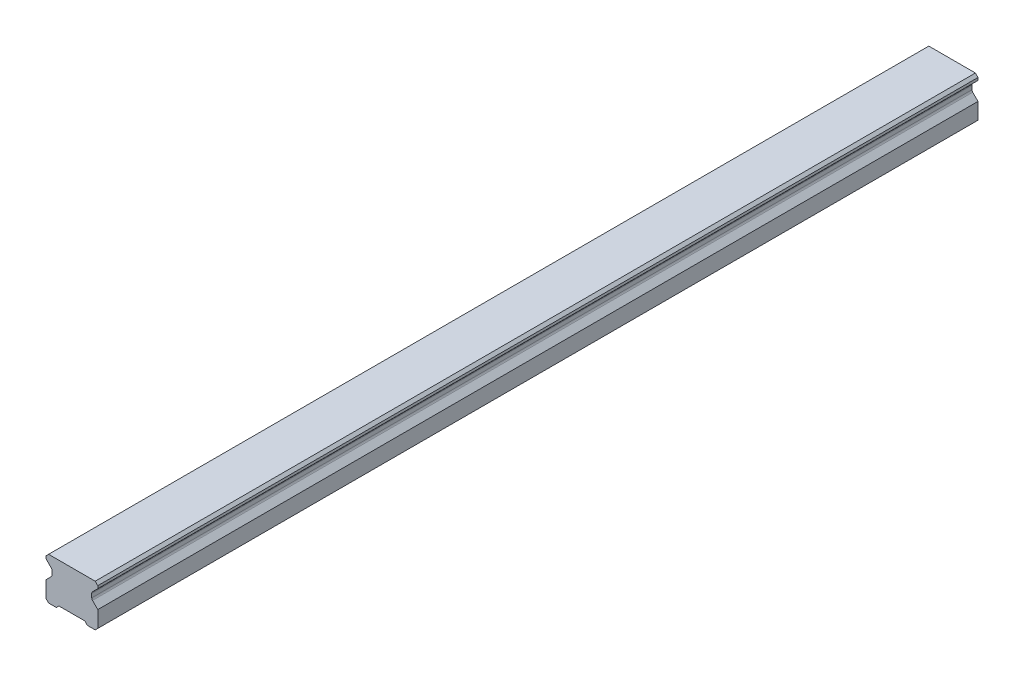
ISO-10303-21;
HEADER;
FILE_DESCRIPTION(('STEP AP214'),'2;1');
FILE_NAME('part.step','',(''),(''),'','','');
FILE_SCHEMA(('AUTOMOTIVE_DESIGN { 1 0 10303 214 1 1 1 1 }'));
ENDSEC;
DATA;
#1=APPLICATION_CONTEXT('core data for automotive mechanical design processes');
#2=APPLICATION_PROTOCOL_DEFINITION('international standard','automotive_design',2000,#1);
#3=PRODUCT_CONTEXT('',#1,'mechanical');
#4=PRODUCT('Part','Part','',(#3));
#5=PRODUCT_RELATED_PRODUCT_CATEGORY('part','',(#4));
#6=PRODUCT_DEFINITION_FORMATION('','',#4);
#7=PRODUCT_DEFINITION_CONTEXT('part definition',#1,'design');
#8=PRODUCT_DEFINITION('design','',#6,#7);
#9=PRODUCT_DEFINITION_SHAPE('','',#8);
#10=(LENGTH_UNIT() NAMED_UNIT(*) SI_UNIT(.MILLI.,.METRE.));
#11=(NAMED_UNIT(*) PLANE_ANGLE_UNIT() SI_UNIT($,.RADIAN.));
#12=(NAMED_UNIT(*) SI_UNIT($,.STERADIAN.) SOLID_ANGLE_UNIT());
#13=UNCERTAINTY_MEASURE_WITH_UNIT(LENGTH_MEASURE(1.E-05),#10,'distance_accuracy_value','');
#14=(GEOMETRIC_REPRESENTATION_CONTEXT(3) GLOBAL_UNCERTAINTY_ASSIGNED_CONTEXT((#13)) GLOBAL_UNIT_ASSIGNED_CONTEXT((#10,
#11,#12)) REPRESENTATION_CONTEXT('',''));
#15=CARTESIAN_POINT('',(0.,0.,0.));
#16=DIRECTION('',(0.,0.,1.));
#17=DIRECTION('',(1.,0.,0.));
#18=AXIS2_PLACEMENT_3D('',#15,#16,#17);
#19=CARTESIAN_POINT('',(0.,11.,-150.));
#20=DIRECTION('',(0.,-1.,0.));
#21=DIRECTION('',(0.,0.,-1.));
#22=AXIS2_PLACEMENT_3D('',#19,#20,#21);
#23=PLANE('',#22);
#24=CARTESIAN_POINT('',(0.,11.,-150.));
#25=DIRECTION('',(0.,-1.,0.));
#26=DIRECTION('',(0.,0.,-1.));
#27=AXIS2_PLACEMENT_3D('',#24,#25,#26);
#28=CIRCLE('',#27,2.5);
#29=CARTESIAN_POINT('',(0.,11.,-152.5));
#30=VERTEX_POINT('',#29);
#31=EDGE_CURVE('E42',#30,#30,#28,.T.);
#32=ORIENTED_EDGE('',*,*,#31,.F.);
#33=EDGE_LOOP('',(#32));
#34=FACE_BOUND('',#33,.T.);
#35=CARTESIAN_POINT('',(0.,11.,-150.));
#36=DIRECTION('',(0.,-1.,0.));
#37=DIRECTION('',(0.,0.,-1.));
#38=AXIS2_PLACEMENT_3D('',#35,#36,#37);
#39=CIRCLE('',#38,3.);
#40=CARTESIAN_POINT('',(0.,11.,-153.));
#41=VERTEX_POINT('',#40);
#42=EDGE_CURVE('E11',#41,#41,#39,.T.);
#43=ORIENTED_EDGE('',*,*,#42,.T.);
#44=EDGE_LOOP('',(#43));
#45=FACE_BOUND('',#44,.T.);
#46=ADVANCED_FACE('F39',(#34,#45),#23,.T.);
#47=CARTESIAN_POINT('',(0.,11.,-150.));
#48=DIRECTION('',(0.,-1.,0.));
#49=DIRECTION('',(0.,0.,-1.));
#50=AXIS2_PLACEMENT_3D('',#47,#48,#49);
#51=CYLINDRICAL_SURFACE('',#50,3.);
#52=ORIENTED_EDGE('',*,*,#42,.F.);
#53=EDGE_LOOP('',(#52));
#54=FACE_BOUND('',#53,.T.);
#55=CARTESIAN_POINT('',(0.,1.,-150.));
#56=DIRECTION('',(0.,-1.,0.));
#57=DIRECTION('',(0.,0.,-1.));
#58=AXIS2_PLACEMENT_3D('',#55,#56,#57);
#59=CIRCLE('',#58,3.);
#60=CARTESIAN_POINT('',(0.,1.,-153.));
#61=VERTEX_POINT('',#60);
#62=EDGE_CURVE('E48',#61,#61,#59,.T.);
#63=ORIENTED_EDGE('',*,*,#62,.T.);
#64=EDGE_LOOP('',(#63));
#65=FACE_BOUND('',#64,.T.);
#66=ADVANCED_FACE('F557',(#54,#65),#51,.F.);
#67=CARTESIAN_POINT('',(0.,11.,-90.));
#68=DIRECTION('',(0.,-1.,0.));
#69=DIRECTION('',(0.,0.,-1.));
#70=AXIS2_PLACEMENT_3D('',#67,#68,#69);
#71=PLANE('',#70);
#72=CARTESIAN_POINT('',(0.,11.,-90.));
#73=DIRECTION('',(0.,-1.,0.));
#74=DIRECTION('',(0.,0.,-1.));
#75=AXIS2_PLACEMENT_3D('',#72,#73,#74);
#76=CIRCLE('',#75,2.5);
#77=CARTESIAN_POINT('',(0.,11.,-92.5));
#78=VERTEX_POINT('',#77);
#79=EDGE_CURVE('E543',#78,#78,#76,.T.);
#80=ORIENTED_EDGE('',*,*,#79,.F.);
#81=EDGE_LOOP('',(#80));
#82=FACE_BOUND('',#81,.T.);
#83=CARTESIAN_POINT('',(0.,11.,-90.));
#84=DIRECTION('',(0.,-1.,0.));
#85=DIRECTION('',(0.,0.,-1.));
#86=AXIS2_PLACEMENT_3D('',#83,#84,#85);
#87=CIRCLE('',#86,3.);
#88=CARTESIAN_POINT('',(0.,11.,-93.));
#89=VERTEX_POINT('',#88);
#90=EDGE_CURVE('E530',#89,#89,#87,.T.);
#91=ORIENTED_EDGE('',*,*,#90,.T.);
#92=EDGE_LOOP('',(#91));
#93=FACE_BOUND('',#92,.T.);
#94=ADVANCED_FACE('F562',(#82,#93),#71,.T.);
#95=CARTESIAN_POINT('',(0.,11.,-90.));
#96=DIRECTION('',(0.,-1.,0.));
#97=DIRECTION('',(0.,0.,-1.));
#98=AXIS2_PLACEMENT_3D('',#95,#96,#97);
#99=CYLINDRICAL_SURFACE('',#98,3.);
#100=ORIENTED_EDGE('',*,*,#90,.F.);
#101=EDGE_LOOP('',(#100));
#102=FACE_BOUND('',#101,.T.);
#103=CARTESIAN_POINT('',(0.,1.,-90.));
#104=DIRECTION('',(0.,-1.,0.));
#105=DIRECTION('',(0.,0.,-1.));
#106=AXIS2_PLACEMENT_3D('',#103,#104,#105);
#107=CIRCLE('',#106,3.);
#108=CARTESIAN_POINT('',(0.,1.,-93.));
#109=VERTEX_POINT('',#108);
#110=EDGE_CURVE('E526',#109,#109,#107,.T.);
#111=ORIENTED_EDGE('',*,*,#110,.T.);
#112=EDGE_LOOP('',(#111));
#113=FACE_BOUND('',#112,.T.);
#114=ADVANCED_FACE('F681',(#102,#113),#99,.F.);
#115=CARTESIAN_POINT('',(0.,11.,-30.));
#116=DIRECTION('',(0.,-1.,0.));
#117=DIRECTION('',(0.,0.,-1.));
#118=AXIS2_PLACEMENT_3D('',#115,#116,#117);
#119=PLANE('',#118);
#120=CARTESIAN_POINT('',(0.,11.,-30.));
#121=DIRECTION('',(0.,-1.,0.));
#122=DIRECTION('',(0.,0.,-1.));
#123=AXIS2_PLACEMENT_3D('',#120,#121,#122);
#124=CIRCLE('',#123,2.5);
#125=CARTESIAN_POINT('',(0.,11.,-32.5));
#126=VERTEX_POINT('',#125);
#127=EDGE_CURVE('E540',#126,#126,#124,.T.);
#128=ORIENTED_EDGE('',*,*,#127,.F.);
#129=EDGE_LOOP('',(#128));
#130=FACE_BOUND('',#129,.T.);
#131=CARTESIAN_POINT('',(0.,11.,-30.));
#132=DIRECTION('',(0.,-1.,0.));
#133=DIRECTION('',(0.,0.,-1.));
#134=AXIS2_PLACEMENT_3D('',#131,#132,#133);
#135=CIRCLE('',#134,3.);
#136=CARTESIAN_POINT('',(0.,11.,-33.));
#137=VERTEX_POINT('',#136);
#138=EDGE_CURVE('E522',#137,#137,#135,.T.);
#139=ORIENTED_EDGE('',*,*,#138,.T.);
#140=EDGE_LOOP('',(#139));
#141=FACE_BOUND('',#140,.T.);
#142=ADVANCED_FACE('F677',(#130,#141),#119,.T.);
#143=CARTESIAN_POINT('',(0.,11.,-30.));
#144=DIRECTION('',(0.,-1.,0.));
#145=DIRECTION('',(0.,0.,-1.));
#146=AXIS2_PLACEMENT_3D('',#143,#144,#145);
#147=CYLINDRICAL_SURFACE('',#146,3.);
#148=ORIENTED_EDGE('',*,*,#138,.F.);
#149=EDGE_LOOP('',(#148));
#150=FACE_BOUND('',#149,.T.);
#151=CARTESIAN_POINT('',(0.,1.,-30.));
#152=DIRECTION('',(0.,-1.,0.));
#153=DIRECTION('',(0.,0.,-1.));
#154=AXIS2_PLACEMENT_3D('',#151,#152,#153);
#155=CIRCLE('',#154,3.);
#156=CARTESIAN_POINT('',(0.,1.,-33.));
#157=VERTEX_POINT('',#156);
#158=EDGE_CURVE('E518',#157,#157,#155,.T.);
#159=ORIENTED_EDGE('',*,*,#158,.T.);
#160=EDGE_LOOP('',(#159));
#161=FACE_BOUND('',#160,.T.);
#162=ADVANCED_FACE('F673',(#150,#161),#147,.F.);
#163=CARTESIAN_POINT('',(0.,11.,30.));
#164=DIRECTION('',(0.,-1.,0.));
#165=DIRECTION('',(0.,0.,-1.));
#166=AXIS2_PLACEMENT_3D('',#163,#164,#165);
#167=PLANE('',#166);
#168=CARTESIAN_POINT('',(0.,11.,30.));
#169=DIRECTION('',(0.,-1.,0.));
#170=DIRECTION('',(0.,0.,-1.));
#171=AXIS2_PLACEMENT_3D('',#168,#169,#170);
#172=CIRCLE('',#171,2.5);
#173=CARTESIAN_POINT('',(0.,11.,27.5));
#174=VERTEX_POINT('',#173);
#175=EDGE_CURVE('E236',#174,#174,#172,.T.);
#176=ORIENTED_EDGE('',*,*,#175,.F.);
#177=EDGE_LOOP('',(#176));
#178=FACE_BOUND('',#177,.T.);
#179=CARTESIAN_POINT('',(0.,11.,30.));
#180=DIRECTION('',(0.,-1.,0.));
#181=DIRECTION('',(0.,0.,-1.));
#182=AXIS2_PLACEMENT_3D('',#179,#180,#181);
#183=CIRCLE('',#182,3.);
#184=CARTESIAN_POINT('',(0.,11.,27.));
#185=VERTEX_POINT('',#184);
#186=EDGE_CURVE('E514',#185,#185,#183,.T.);
#187=ORIENTED_EDGE('',*,*,#186,.T.);
#188=EDGE_LOOP('',(#187));
#189=FACE_BOUND('',#188,.T.);
#190=ADVANCED_FACE('F669',(#178,#189),#167,.T.);
#191=CARTESIAN_POINT('',(0.,11.,30.));
#192=DIRECTION('',(0.,-1.,0.));
#193=DIRECTION('',(0.,0.,-1.));
#194=AXIS2_PLACEMENT_3D('',#191,#192,#193);
#195=CYLINDRICAL_SURFACE('',#194,3.);
#196=ORIENTED_EDGE('',*,*,#186,.F.);
#197=EDGE_LOOP('',(#196));
#198=FACE_BOUND('',#197,.T.);
#199=CARTESIAN_POINT('',(0.,1.,30.));
#200=DIRECTION('',(0.,-1.,0.));
#201=DIRECTION('',(0.,0.,-1.));
#202=AXIS2_PLACEMENT_3D('',#199,#200,#201);
#203=CIRCLE('',#202,3.);
#204=CARTESIAN_POINT('',(0.,1.,27.));
#205=VERTEX_POINT('',#204);
#206=EDGE_CURVE('E510',#205,#205,#203,.T.);
#207=ORIENTED_EDGE('',*,*,#206,.T.);
#208=EDGE_LOOP('',(#207));
#209=FACE_BOUND('',#208,.T.);
#210=ADVANCED_FACE('F666',(#198,#209),#195,.F.);
#211=CARTESIAN_POINT('',(10.,0.,170.));
#212=DIRECTION('',(0.,1.,0.));
#213=DIRECTION('',(-1.,0.,0.));
#214=AXIS2_PLACEMENT_3D('',#211,#212,#213);
#215=PLANE('',#214);
#216=DIRECTION('',(1.,0.,0.));
#217=VECTOR('',#216,1.);
#218=CARTESIAN_POINT('',(10.,0.,-170.));
#219=LINE('',#218,#217);
#220=CARTESIAN_POINT('',(-8.99999999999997,0.,-170.));
#221=VERTEX_POINT('',#220);
#222=CARTESIAN_POINT('',(-6.,0.,-170.));
#223=VERTEX_POINT('',#222);
#224=EDGE_CURVE('E394',#221,#223,#219,.T.);
#225=ORIENTED_EDGE('',*,*,#224,.T.);
#226=DIRECTION('',(0.,0.,1.));
#227=VECTOR('',#226,1.);
#228=CARTESIAN_POINT('',(-6.,0.,-170.));
#229=LINE('',#228,#227);
#230=CARTESIAN_POINT('',(-6.,0.,170.));
#231=VERTEX_POINT('',#230);
#232=EDGE_CURVE('E299',#223,#231,#229,.T.);
#233=ORIENTED_EDGE('',*,*,#232,.T.);
#234=DIRECTION('',(1.,0.,0.));
#235=VECTOR('',#234,1.);
#236=CARTESIAN_POINT('',(10.,0.,170.));
#237=LINE('',#236,#235);
#238=CARTESIAN_POINT('',(-8.99999999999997,0.,170.));
#239=VERTEX_POINT('',#238);
#240=EDGE_CURVE('E375',#239,#231,#237,.T.);
#241=ORIENTED_EDGE('',*,*,#240,.F.);
#242=DIRECTION('',(0.,0.,-1.));
#243=VECTOR('',#242,1.);
#244=CARTESIAN_POINT('',(-8.99999999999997,0.,170.));
#245=LINE('',#244,#243);
#246=EDGE_CURVE('E446',#239,#221,#245,.T.);
#247=ORIENTED_EDGE('',*,*,#246,.T.);
#248=EDGE_LOOP('',(#225,#233,#241,#247));
#249=FACE_BOUND('',#248,.T.);
#250=ADVANCED_FACE('F631',(#249),#215,.F.);
#251=CARTESIAN_POINT('',(-10.,16.3,170.));
#252=DIRECTION('',(1.,0.,0.));
#253=DIRECTION('',(0.,1.,0.));
#254=AXIS2_PLACEMENT_3D('',#251,#252,#253);
#255=PLANE('',#254);
#256=DIRECTION('',(0.,-1.,0.));
#257=VECTOR('',#256,1.);
#258=CARTESIAN_POINT('',(-10.,16.3,170.));
#259=LINE('',#258,#257);
#260=CARTESIAN_POINT('',(-10.,15.2999999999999,170.));
#261=VERTEX_POINT('',#260);
#262=CARTESIAN_POINT('',(-10.,14.3,170.));
#263=VERTEX_POINT('',#262);
#264=EDGE_CURVE('E369',#261,#263,#259,.T.);
#265=ORIENTED_EDGE('',*,*,#264,.F.);
#266=DIRECTION('',(0.,0.,-1.));
#267=VECTOR('',#266,1.);
#268=CARTESIAN_POINT('',(-10.,15.2999999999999,170.));
#269=LINE('',#268,#267);
#270=CARTESIAN_POINT('',(-10.,15.2999999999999,-170.));
#271=VERTEX_POINT('',#270);
#272=EDGE_CURVE('E388',#261,#271,#269,.T.);
#273=ORIENTED_EDGE('',*,*,#272,.T.);
#274=DIRECTION('',(0.,-1.,0.));
#275=VECTOR('',#274,1.);
#276=CARTESIAN_POINT('',(-10.,16.3,-170.));
#277=LINE('',#276,#275);
#278=CARTESIAN_POINT('',(-10.,14.3,-170.));
#279=VERTEX_POINT('',#278);
#280=EDGE_CURVE('E389',#271,#279,#277,.T.);
#281=ORIENTED_EDGE('',*,*,#280,.T.);
#282=DIRECTION('',(0.,0.,1.));
#283=VECTOR('',#282,1.);
#284=CARTESIAN_POINT('',(-10.,14.3,-170.));
#285=LINE('',#284,#283);
#286=EDGE_CURVE('E323',#279,#263,#285,.T.);
#287=ORIENTED_EDGE('',*,*,#286,.T.);
#288=EDGE_LOOP('',(#265,#273,#281,#287));
#289=FACE_BOUND('',#288,.T.);
#290=ADVANCED_FACE('F635',(#289),#255,.F.);
#291=CARTESIAN_POINT('',(10.,16.3,170.));
#292=DIRECTION('',(-1.,0.,0.));
#293=DIRECTION('',(0.,-1.,0.));
#294=AXIS2_PLACEMENT_3D('',#291,#292,#293);
#295=PLANE('',#294);
#296=DIRECTION('',(0.,1.,0.));
#297=VECTOR('',#296,1.);
#298=CARTESIAN_POINT('',(10.,16.3,170.));
#299=LINE('',#298,#297);
#300=CARTESIAN_POINT('',(10.,1.00000000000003,170.));
#301=VERTEX_POINT('',#300);
#302=CARTESIAN_POINT('',(10.,7.3,170.));
#303=VERTEX_POINT('',#302);
#304=EDGE_CURVE('E380',#301,#303,#299,.T.);
#305=ORIENTED_EDGE('',*,*,#304,.F.);
#306=DIRECTION('',(0.,0.,-1.));
#307=VECTOR('',#306,1.);
#308=CARTESIAN_POINT('',(10.,1.00000000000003,170.));
#309=LINE('',#308,#307);
#310=CARTESIAN_POINT('',(10.,1.00000000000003,-170.));
#311=VERTEX_POINT('',#310);
#312=EDGE_CURVE('E453',#301,#311,#309,.T.);
#313=ORIENTED_EDGE('',*,*,#312,.T.);
#314=DIRECTION('',(0.,1.,0.));
#315=VECTOR('',#314,1.);
#316=CARTESIAN_POINT('',(10.,16.3,-170.));
#317=LINE('',#316,#315);
#318=CARTESIAN_POINT('',(10.,7.3,-170.));
#319=VERTEX_POINT('',#318);
#320=EDGE_CURVE('E399',#311,#319,#317,.T.);
#321=ORIENTED_EDGE('',*,*,#320,.T.);
#322=DIRECTION('',(0.,0.,1.));
#323=VECTOR('',#322,1.);
#324=CARTESIAN_POINT('',(10.,7.3,-170.));
#325=LINE('',#324,#323);
#326=EDGE_CURVE('E354',#319,#303,#325,.T.);
#327=ORIENTED_EDGE('',*,*,#326,.T.);
#328=EDGE_LOOP('',(#305,#313,#321,#327));
#329=FACE_BOUND('',#328,.T.);
#330=ADVANCED_FACE('F626',(#329),#295,.F.);
#331=CARTESIAN_POINT('',(-10.,7.3,-170.));
#332=VERTEX_POINT('',#331);
#333=CARTESIAN_POINT('',(-10.,1.00000000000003,-170.));
#334=VERTEX_POINT('',#333);
#335=EDGE_CURVE('E338',#332,#334,#277,.T.);
#336=ORIENTED_EDGE('',*,*,#335,.T.);
#337=DIRECTION('',(0.,0.,1.));
#338=VECTOR('',#337,1.);
#339=CARTESIAN_POINT('',(-10.,1.00000000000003,170.));
#340=LINE('',#339,#338);
#341=CARTESIAN_POINT('',(-10.,1.00000000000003,170.));
#342=VERTEX_POINT('',#341);
#343=EDGE_CURVE('E450',#334,#342,#340,.T.);
#344=ORIENTED_EDGE('',*,*,#343,.T.);
#345=CARTESIAN_POINT('',(-10.,7.3,170.));
#346=VERTEX_POINT('',#345);
#347=EDGE_CURVE('E374',#346,#342,#259,.T.);
#348=ORIENTED_EDGE('',*,*,#347,.F.);
#349=DIRECTION('',(0.,0.,1.));
#350=VECTOR('',#349,1.);
#351=CARTESIAN_POINT('',(-10.,7.3,-170.));
#352=LINE('',#351,#350);
#353=EDGE_CURVE('E335',#332,#346,#352,.T.);
#354=ORIENTED_EDGE('',*,*,#353,.F.);
#355=EDGE_LOOP('',(#336,#344,#348,#354));
#356=FACE_BOUND('',#355,.T.);
#357=ADVANCED_FACE('F629',(#356),#255,.F.);
#358=CARTESIAN_POINT('',(6.,0.,170.));
#359=VERTEX_POINT('',#358);
#360=CARTESIAN_POINT('',(8.99999999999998,0.,170.));
#361=VERTEX_POINT('',#360);
#362=EDGE_CURVE('E373',#359,#361,#237,.T.);
#363=ORIENTED_EDGE('',*,*,#362,.F.);
#364=DIRECTION('',(0.,0.,1.));
#365=VECTOR('',#364,1.);
#366=CARTESIAN_POINT('',(6.,0.,-170.));
#367=LINE('',#366,#365);
#368=CARTESIAN_POINT('',(6.,0.,-170.));
#369=VERTEX_POINT('',#368);
#370=EDGE_CURVE('E289',#369,#359,#367,.T.);
#371=ORIENTED_EDGE('',*,*,#370,.F.);
#372=CARTESIAN_POINT('',(8.99999999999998,0.,-170.));
#373=VERTEX_POINT('',#372);
#374=EDGE_CURVE('E393',#369,#373,#219,.T.);
#375=ORIENTED_EDGE('',*,*,#374,.T.);
#376=DIRECTION('',(0.,0.,1.));
#377=VECTOR('',#376,1.);
#378=CARTESIAN_POINT('',(8.99999999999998,0.,170.));
#379=LINE('',#378,#377);
#380=EDGE_CURVE('E442',#373,#361,#379,.T.);
#381=ORIENTED_EDGE('',*,*,#380,.T.);
#382=EDGE_LOOP('',(#363,#371,#375,#381));
#383=FACE_BOUND('',#382,.T.);
#384=ADVANCED_FACE('F624',(#383),#215,.F.);
#385=CARTESIAN_POINT('',(10.,14.3,-170.));
#386=VERTEX_POINT('',#385);
#387=CARTESIAN_POINT('',(10.,15.3,-170.));
#388=VERTEX_POINT('',#387);
#389=EDGE_CURVE('E398',#386,#388,#317,.T.);
#390=ORIENTED_EDGE('',*,*,#389,.T.);
#391=DIRECTION('',(0.,0.,1.));
#392=VECTOR('',#391,1.);
#393=CARTESIAN_POINT('',(10.,15.3,170.));
#394=LINE('',#393,#392);
#395=CARTESIAN_POINT('',(10.,15.3,170.));
#396=VERTEX_POINT('',#395);
#397=EDGE_CURVE('E457',#388,#396,#394,.T.);
#398=ORIENTED_EDGE('',*,*,#397,.T.);
#399=CARTESIAN_POINT('',(10.,14.3,170.));
#400=VERTEX_POINT('',#399);
#401=EDGE_CURVE('E379',#400,#396,#299,.T.);
#402=ORIENTED_EDGE('',*,*,#401,.F.);
#403=DIRECTION('',(0.,0.,1.));
#404=VECTOR('',#403,1.);
#405=CARTESIAN_POINT('',(10.,14.3,-170.));
#406=LINE('',#405,#404);
#407=EDGE_CURVE('E328',#386,#400,#406,.T.);
#408=ORIENTED_EDGE('',*,*,#407,.F.);
#409=EDGE_LOOP('',(#390,#398,#402,#408));
#410=FACE_BOUND('',#409,.T.);
#411=ADVANCED_FACE('F620',(#410),#295,.F.);
#412=CARTESIAN_POINT('',(10.,16.3,170.));
#413=DIRECTION('',(0.,-1.,0.));
#414=DIRECTION('',(0.,0.,-1.));
#415=AXIS2_PLACEMENT_3D('',#412,#413,#414);
#416=PLANE('',#415);
#417=DIRECTION('',(-1.,0.,0.));
#418=VECTOR('',#417,1.);
#419=CARTESIAN_POINT('',(10.,16.3,-170.));
#420=LINE('',#419,#418);
#421=CARTESIAN_POINT('',(9.00000000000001,16.3,-170.));
#422=VERTEX_POINT('',#421);
#423=CARTESIAN_POINT('',(-8.99999999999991,16.3,-170.));
#424=VERTEX_POINT('',#423);
#425=EDGE_CURVE('E403',#422,#424,#420,.T.);
#426=ORIENTED_EDGE('',*,*,#425,.T.);
#427=DIRECTION('',(0.,0.,1.));
#428=VECTOR('',#427,1.);
#429=CARTESIAN_POINT('',(-8.99999999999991,16.3,170.));
#430=LINE('',#429,#428);
#431=CARTESIAN_POINT('',(-8.99999999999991,16.3,170.));
#432=VERTEX_POINT('',#431);
#433=EDGE_CURVE('E427',#424,#432,#430,.T.);
#434=ORIENTED_EDGE('',*,*,#433,.T.);
#435=DIRECTION('',(-1.,0.,0.));
#436=VECTOR('',#435,1.);
#437=CARTESIAN_POINT('',(10.,16.3,170.));
#438=LINE('',#437,#436);
#439=CARTESIAN_POINT('',(9.00000000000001,16.3,170.));
#440=VERTEX_POINT('',#439);
#441=EDGE_CURVE('E384',#440,#432,#438,.T.);
#442=ORIENTED_EDGE('',*,*,#441,.F.);
#443=DIRECTION('',(0.,0.,-1.));
#444=VECTOR('',#443,1.);
#445=CARTESIAN_POINT('',(9.00000000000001,16.3,170.));
#446=LINE('',#445,#444);
#447=EDGE_CURVE('E423',#440,#422,#446,.T.);
#448=ORIENTED_EDGE('',*,*,#447,.T.);
#449=EDGE_LOOP('',(#426,#434,#442,#448));
#450=FACE_BOUND('',#449,.T.);
#451=ADVANCED_FACE('F614',(#450),#416,.F.);
#452=CARTESIAN_POINT('',(0.,0.,170.));
#453=DIRECTION('',(0.,0.,-1.));
#454=DIRECTION('',(-1.,0.,0.));
#455=AXIS2_PLACEMENT_3D('',#452,#453,#454);
#456=PLANE('',#455);
#457=ORIENTED_EDGE('',*,*,#240,.T.);
#458=DIRECTION('',(-0.707106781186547,-0.707106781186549,0.));
#459=VECTOR('',#458,1.);
#460=CARTESIAN_POINT('',(-6.,0.,170.));
#461=LINE('',#460,#459);
#462=CARTESIAN_POINT('',(-5.,1.,170.));
#463=VERTEX_POINT('',#462);
#464=EDGE_CURVE('E282',#463,#231,#461,.T.);
#465=ORIENTED_EDGE('',*,*,#464,.F.);
#466=DIRECTION('',(-1.,0.,0.));
#467=VECTOR('',#466,1.);
#468=CARTESIAN_POINT('',(-5.,1.,170.));
#469=LINE('',#468,#467);
#470=CARTESIAN_POINT('',(5.,1.,170.));
#471=VERTEX_POINT('',#470);
#472=EDGE_CURVE('E293',#471,#463,#469,.T.);
#473=ORIENTED_EDGE('',*,*,#472,.F.);
#474=DIRECTION('',(-0.707106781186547,0.707106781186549,0.));
#475=VECTOR('',#474,1.);
#476=CARTESIAN_POINT('',(5.,1.,170.));
#477=LINE('',#476,#475);
#478=EDGE_CURVE('E274',#359,#471,#477,.T.);
#479=ORIENTED_EDGE('',*,*,#478,.F.);
#480=ORIENTED_EDGE('',*,*,#362,.T.);
#481=DIRECTION('',(-0.707106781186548,-0.707106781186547,0.));
#482=VECTOR('',#481,1.);
#483=CARTESIAN_POINT('',(10.,1.00000000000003,170.));
#484=LINE('',#483,#482);
#485=EDGE_CURVE('E433',#361,#301,#484,.F.);
#486=ORIENTED_EDGE('',*,*,#485,.T.);
#487=ORIENTED_EDGE('',*,*,#304,.T.);
#488=DIRECTION('',(0.707106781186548,-0.707106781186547,0.));
#489=VECTOR('',#488,1.);
#490=CARTESIAN_POINT('',(10.,7.3,170.));
#491=LINE('',#490,#489);
#492=CARTESIAN_POINT('',(7.95955988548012,9.34044011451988,170.));
#493=VERTEX_POINT('',#492);
#494=EDGE_CURVE('E303',#493,#303,#491,.T.);
#495=ORIENTED_EDGE('',*,*,#494,.F.);
#496=CARTESIAN_POINT('',(8.66666666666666,10.0475468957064,170.));
#497=DIRECTION('',(0.,0.,-1.));
#498=DIRECTION('',(-1.,0.,0.));
#499=AXIS2_PLACEMENT_3D('',#496,#497,#498);
#500=CIRCLE('',#499,1.);
#501=CARTESIAN_POINT('',(7.66666666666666,10.0475468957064,170.));
#502=VERTEX_POINT('',#501);
#503=EDGE_CURVE('E487',#493,#502,#500,.T.);
#504=ORIENTED_EDGE('',*,*,#503,.T.);
#505=DIRECTION('',(0.,-1.,0.));
#506=VECTOR('',#505,1.);
#507=CARTESIAN_POINT('',(7.66666666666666,9.63333333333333,170.));
#508=LINE('',#507,#506);
#509=CARTESIAN_POINT('',(7.66666666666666,11.5524531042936,170.));
#510=VERTEX_POINT('',#509);
#511=EDGE_CURVE('E346',#510,#502,#508,.T.);
#512=ORIENTED_EDGE('',*,*,#511,.F.);
#513=CARTESIAN_POINT('',(8.66666666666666,11.5524531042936,170.));
#514=DIRECTION('',(0.,0.,-1.));
#515=DIRECTION('',(-1.,0.,0.));
#516=AXIS2_PLACEMENT_3D('',#513,#514,#515);
#517=CIRCLE('',#516,1.);
#518=CARTESIAN_POINT('',(7.95955988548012,12.2595598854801,170.));
#519=VERTEX_POINT('',#518);
#520=EDGE_CURVE('E493',#510,#519,#517,.T.);
#521=ORIENTED_EDGE('',*,*,#520,.T.);
#522=DIRECTION('',(-0.707106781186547,-0.707106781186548,0.));
#523=VECTOR('',#522,1.);
#524=CARTESIAN_POINT('',(7.66666666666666,11.9666666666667,170.));
#525=LINE('',#524,#523);
#526=EDGE_CURVE('E357',#400,#519,#525,.T.);
#527=ORIENTED_EDGE('',*,*,#526,.F.);
#528=ORIENTED_EDGE('',*,*,#401,.T.);
#529=DIRECTION('',(0.707106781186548,-0.707106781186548,0.));
#530=VECTOR('',#529,1.);
#531=CARTESIAN_POINT('',(9.00000000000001,16.3,170.));
#532=LINE('',#531,#530);
#533=EDGE_CURVE('E430',#396,#440,#532,.F.);
#534=ORIENTED_EDGE('',*,*,#533,.T.);
#535=ORIENTED_EDGE('',*,*,#441,.T.);
#536=DIRECTION('',(0.707106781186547,0.707106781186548,0.));
#537=VECTOR('',#536,1.);
#538=CARTESIAN_POINT('',(-10.,15.2999999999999,170.));
#539=LINE('',#538,#537);
#540=EDGE_CURVE('E439',#432,#261,#539,.F.);
#541=ORIENTED_EDGE('',*,*,#540,.T.);
#542=ORIENTED_EDGE('',*,*,#264,.T.);
#543=DIRECTION('',(-0.707106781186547,0.707106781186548,0.));
#544=VECTOR('',#543,1.);
#545=CARTESIAN_POINT('',(-7.66666666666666,11.9666666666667,170.));
#546=LINE('',#545,#544);
#547=CARTESIAN_POINT('',(-7.95955988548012,12.2595598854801,170.));
#548=VERTEX_POINT('',#547);
#549=EDGE_CURVE('E324',#548,#263,#546,.T.);
#550=ORIENTED_EDGE('',*,*,#549,.F.);
#551=CARTESIAN_POINT('',(-8.66666666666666,11.5524531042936,170.));
#552=DIRECTION('',(0.,0.,-1.));
#553=DIRECTION('',(-1.,0.,0.));
#554=AXIS2_PLACEMENT_3D('',#551,#552,#553);
#555=CIRCLE('',#554,1.);
#556=CARTESIAN_POINT('',(-7.66666666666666,11.5524531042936,170.));
#557=VERTEX_POINT('',#556);
#558=EDGE_CURVE('E505',#548,#557,#555,.T.);
#559=ORIENTED_EDGE('',*,*,#558,.T.);
#560=DIRECTION('',(0.,1.,0.));
#561=VECTOR('',#560,1.);
#562=CARTESIAN_POINT('',(-7.66666666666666,9.63333333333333,170.));
#563=LINE('',#562,#561);
#564=CARTESIAN_POINT('',(-7.66666666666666,10.0475468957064,170.));
#565=VERTEX_POINT('',#564);
#566=EDGE_CURVE('E316',#565,#557,#563,.T.);
#567=ORIENTED_EDGE('',*,*,#566,.F.);
#568=CARTESIAN_POINT('',(-8.66666666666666,10.0475468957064,170.));
#569=DIRECTION('',(0.,0.,-1.));
#570=DIRECTION('',(-1.,0.,0.));
#571=AXIS2_PLACEMENT_3D('',#568,#569,#570);
#572=CIRCLE('',#571,1.);
#573=CARTESIAN_POINT('',(-7.95955988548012,9.34044011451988,170.));
#574=VERTEX_POINT('',#573);
#575=EDGE_CURVE('E499',#565,#574,#572,.T.);
#576=ORIENTED_EDGE('',*,*,#575,.T.);
#577=DIRECTION('',(0.707106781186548,0.707106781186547,0.));
#578=VECTOR('',#577,1.);
#579=CARTESIAN_POINT('',(-10.,7.3,170.));
#580=LINE('',#579,#578);
#581=EDGE_CURVE('E327',#346,#574,#580,.T.);
#582=ORIENTED_EDGE('',*,*,#581,.F.);
#583=ORIENTED_EDGE('',*,*,#347,.T.);
#584=DIRECTION('',(-0.707106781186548,0.707106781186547,0.));
#585=VECTOR('',#584,1.);
#586=CARTESIAN_POINT('',(-8.99999999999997,0.,170.));
#587=LINE('',#586,#585);
#588=EDGE_CURVE('E436',#342,#239,#587,.F.);
#589=ORIENTED_EDGE('',*,*,#588,.T.);
#590=EDGE_LOOP('',(#457,#465,#473,#479,#480,#486,#487,#495,#504,#512,#521,#527,#528,#534,#535,
#541,#542,#550,#559,#567,#576,#582,#583,#589));
#591=FACE_BOUND('',#590,.T.);
#592=ADVANCED_FACE('F611',(#591),#456,.F.);
#593=CARTESIAN_POINT('',(0.,0.,-170.));
#594=DIRECTION('',(0.,0.,-1.));
#595=DIRECTION('',(-1.,0.,0.));
#596=AXIS2_PLACEMENT_3D('',#593,#594,#595);
#597=PLANE('',#596);
#598=DIRECTION('',(-0.707106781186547,-0.707106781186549,0.));
#599=VECTOR('',#598,1.);
#600=CARTESIAN_POINT('',(-6.,0.,-170.));
#601=LINE('',#600,#599);
#602=CARTESIAN_POINT('',(-5.,1.,-170.));
#603=VERTEX_POINT('',#602);
#604=EDGE_CURVE('E285',#603,#223,#601,.T.);
#605=ORIENTED_EDGE('',*,*,#604,.T.);
#606=ORIENTED_EDGE('',*,*,#224,.F.);
#607=DIRECTION('',(0.707106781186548,-0.707106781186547,0.));
#608=VECTOR('',#607,1.);
#609=CARTESIAN_POINT('',(-4.49999999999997,-4.49999999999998,-170.));
#610=LINE('',#609,#608);
#611=EDGE_CURVE('E417',#221,#334,#610,.F.);
#612=ORIENTED_EDGE('',*,*,#611,.T.);
#613=ORIENTED_EDGE('',*,*,#335,.F.);
#614=DIRECTION('',(0.707106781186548,0.707106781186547,0.));
#615=VECTOR('',#614,1.);
#616=CARTESIAN_POINT('',(-10.,7.3,-170.));
#617=LINE('',#616,#615);
#618=CARTESIAN_POINT('',(-7.95955988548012,9.34044011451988,-170.));
#619=VERTEX_POINT('',#618);
#620=EDGE_CURVE('E315',#332,#619,#617,.T.);
#621=ORIENTED_EDGE('',*,*,#620,.T.);
#622=CARTESIAN_POINT('',(-8.66666666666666,10.0475468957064,-170.));
#623=DIRECTION('',(0.,0.,-1.));
#624=DIRECTION('',(-1.,0.,0.));
#625=AXIS2_PLACEMENT_3D('',#622,#623,#624);
#626=CIRCLE('',#625,1.);
#627=CARTESIAN_POINT('',(-7.66666666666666,10.0475468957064,-170.));
#628=VERTEX_POINT('',#627);
#629=EDGE_CURVE('E502',#619,#628,#626,.F.);
#630=ORIENTED_EDGE('',*,*,#629,.T.);
#631=DIRECTION('',(0.,1.,0.));
#632=VECTOR('',#631,1.);
#633=CARTESIAN_POINT('',(-7.66666666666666,9.63333333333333,-170.));
#634=LINE('',#633,#632);
#635=CARTESIAN_POINT('',(-7.66666666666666,11.5524531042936,-170.));
#636=VERTEX_POINT('',#635);
#637=EDGE_CURVE('E320',#628,#636,#634,.T.);
#638=ORIENTED_EDGE('',*,*,#637,.T.);
#639=CARTESIAN_POINT('',(-8.66666666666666,11.5524531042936,-170.));
#640=DIRECTION('',(0.,0.,-1.));
#641=DIRECTION('',(-1.,0.,0.));
#642=AXIS2_PLACEMENT_3D('',#639,#640,#641);
#643=CIRCLE('',#642,1.);
#644=CARTESIAN_POINT('',(-7.95955988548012,12.2595598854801,-170.));
#645=VERTEX_POINT('',#644);
#646=EDGE_CURVE('E64',#636,#645,#643,.F.);
#647=ORIENTED_EDGE('',*,*,#646,.T.);
#648=DIRECTION('',(-0.707106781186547,0.707106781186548,0.));
#649=VECTOR('',#648,1.);
#650=CARTESIAN_POINT('',(-7.66666666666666,11.9666666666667,-170.));
#651=LINE('',#650,#649);
#652=EDGE_CURVE('E312',#645,#279,#651,.T.);
#653=ORIENTED_EDGE('',*,*,#652,.T.);
#654=ORIENTED_EDGE('',*,*,#280,.F.);
#655=DIRECTION('',(-0.707106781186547,-0.707106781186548,0.));
#656=VECTOR('',#655,1.);
#657=CARTESIAN_POINT('',(-12.65,12.6499999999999,-170.));
#658=LINE('',#657,#656);
#659=EDGE_CURVE('E420',#271,#424,#658,.F.);
#660=ORIENTED_EDGE('',*,*,#659,.T.);
#661=ORIENTED_EDGE('',*,*,#425,.F.);
#662=DIRECTION('',(-0.707106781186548,0.707106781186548,0.));
#663=VECTOR('',#662,1.);
#664=CARTESIAN_POINT('',(12.65,12.65,-170.));
#665=LINE('',#664,#663);
#666=EDGE_CURVE('E410',#422,#388,#665,.F.);
#667=ORIENTED_EDGE('',*,*,#666,.T.);
#668=ORIENTED_EDGE('',*,*,#389,.F.);
#669=DIRECTION('',(-0.707106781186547,-0.707106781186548,0.));
#670=VECTOR('',#669,1.);
#671=CARTESIAN_POINT('',(7.66666666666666,11.9666666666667,-170.));
#672=LINE('',#671,#670);
#673=CARTESIAN_POINT('',(7.95955988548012,12.2595598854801,-170.));
#674=VERTEX_POINT('',#673);
#675=EDGE_CURVE('E345',#386,#674,#672,.T.);
#676=ORIENTED_EDGE('',*,*,#675,.T.);
#677=CARTESIAN_POINT('',(8.66666666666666,11.5524531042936,-170.));
#678=DIRECTION('',(0.,0.,-1.));
#679=DIRECTION('',(-1.,0.,0.));
#680=AXIS2_PLACEMENT_3D('',#677,#678,#679);
#681=CIRCLE('',#680,1.);
#682=CARTESIAN_POINT('',(7.66666666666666,11.5524531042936,-170.));
#683=VERTEX_POINT('',#682);
#684=EDGE_CURVE('E496',#674,#683,#681,.F.);
#685=ORIENTED_EDGE('',*,*,#684,.T.);
#686=DIRECTION('',(0.,-1.,0.));
#687=VECTOR('',#686,1.);
#688=CARTESIAN_POINT('',(7.66666666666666,9.63333333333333,-170.));
#689=LINE('',#688,#687);
#690=CARTESIAN_POINT('',(7.66666666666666,10.0475468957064,-170.));
#691=VERTEX_POINT('',#690);
#692=EDGE_CURVE('E350',#683,#691,#689,.T.);
#693=ORIENTED_EDGE('',*,*,#692,.T.);
#694=CARTESIAN_POINT('',(8.66666666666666,10.0475468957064,-170.));
#695=DIRECTION('',(0.,0.,-1.));
#696=DIRECTION('',(-1.,0.,0.));
#697=AXIS2_PLACEMENT_3D('',#694,#695,#696);
#698=CIRCLE('',#697,1.);
#699=CARTESIAN_POINT('',(7.95955988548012,9.34044011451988,-170.));
#700=VERTEX_POINT('',#699);
#701=EDGE_CURVE('E490',#691,#700,#698,.F.);
#702=ORIENTED_EDGE('',*,*,#701,.T.);
#703=DIRECTION('',(0.707106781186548,-0.707106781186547,0.));
#704=VECTOR('',#703,1.);
#705=CARTESIAN_POINT('',(10.,7.3,-170.));
#706=LINE('',#705,#704);
#707=EDGE_CURVE('E342',#700,#319,#706,.T.);
#708=ORIENTED_EDGE('',*,*,#707,.T.);
#709=ORIENTED_EDGE('',*,*,#320,.F.);
#710=DIRECTION('',(0.707106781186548,0.707106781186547,0.));
#711=VECTOR('',#710,1.);
#712=CARTESIAN_POINT('',(4.49999999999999,-4.49999999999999,-170.));
#713=LINE('',#712,#711);
#714=EDGE_CURVE('E413',#311,#373,#713,.F.);
#715=ORIENTED_EDGE('',*,*,#714,.T.);
#716=ORIENTED_EDGE('',*,*,#374,.F.);
#717=DIRECTION('',(-0.707106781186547,0.707106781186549,0.));
#718=VECTOR('',#717,1.);
#719=CARTESIAN_POINT('',(5.,1.,-170.));
#720=LINE('',#719,#718);
#721=CARTESIAN_POINT('',(5.,1.,-170.));
#722=VERTEX_POINT('',#721);
#723=EDGE_CURVE('E278',#369,#722,#720,.T.);
#724=ORIENTED_EDGE('',*,*,#723,.T.);
#725=DIRECTION('',(-1.,0.,0.));
#726=VECTOR('',#725,1.);
#727=CARTESIAN_POINT('',(-5.,1.,-170.));
#728=LINE('',#727,#726);
#729=EDGE_CURVE('E56',#722,#603,#728,.T.);
#730=ORIENTED_EDGE('',*,*,#729,.T.);
#731=EDGE_LOOP('',(#605,#606,#612,#613,#621,#630,#638,#647,#653,#654,#660,#661,#667,#668,#676,
#685,#693,#702,#708,#709,#715,#716,#724,#730));
#732=FACE_BOUND('',#731,.T.);
#733=ADVANCED_FACE('F609',(#732),#597,.T.);
#734=CARTESIAN_POINT('',(10.,7.3,-170.));
#735=DIRECTION('',(-0.707106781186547,-0.707106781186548,0.));
#736=DIRECTION('',(0.707106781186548,-0.707106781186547,0.));
#737=AXIS2_PLACEMENT_3D('',#734,#735,#736);
#738=PLANE('',#737);
#739=ORIENTED_EDGE('',*,*,#707,.F.);
#740=DIRECTION('',(0.,0.,1.));
#741=VECTOR('',#740,1.);
#742=CARTESIAN_POINT('',(7.95955988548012,9.34044011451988,170.));
#743=LINE('',#742,#741);
#744=EDGE_CURVE('E460',#700,#493,#743,.T.);
#745=ORIENTED_EDGE('',*,*,#744,.T.);
#746=ORIENTED_EDGE('',*,*,#494,.T.);
#747=ORIENTED_EDGE('',*,*,#326,.F.);
#748=EDGE_LOOP('',(#739,#745,#746,#747));
#749=FACE_BOUND('',#748,.T.);
#750=ADVANCED_FACE('F602',(#749),#738,.F.);
#751=CARTESIAN_POINT('',(7.66666666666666,9.63333333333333,-170.));
#752=DIRECTION('',(-1.,0.,0.));
#753=DIRECTION('',(0.,-1.,0.));
#754=AXIS2_PLACEMENT_3D('',#751,#752,#753);
#755=PLANE('',#754);
#756=ORIENTED_EDGE('',*,*,#511,.T.);
#757=DIRECTION('',(0.,0.,1.));
#758=VECTOR('',#757,1.);
#759=CARTESIAN_POINT('',(7.66666666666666,10.0475468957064,-170.));
#760=LINE('',#759,#758);
#761=EDGE_CURVE('E468',#502,#691,#760,.F.);
#762=ORIENTED_EDGE('',*,*,#761,.T.);
#763=ORIENTED_EDGE('',*,*,#692,.F.);
#764=DIRECTION('',(0.,0.,1.));
#765=VECTOR('',#764,1.);
#766=CARTESIAN_POINT('',(7.66666666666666,11.5524531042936,170.));
#767=LINE('',#766,#765);
#768=EDGE_CURVE('E464',#683,#510,#767,.T.);
#769=ORIENTED_EDGE('',*,*,#768,.T.);
#770=EDGE_LOOP('',(#756,#762,#763,#769));
#771=FACE_BOUND('',#770,.T.);
#772=ADVANCED_FACE('F599',(#771),#755,.F.);
#773=CARTESIAN_POINT('',(7.66666666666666,11.9666666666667,-170.));
#774=DIRECTION('',(-0.707106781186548,0.707106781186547,0.));
#775=DIRECTION('',(-0.707106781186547,-0.707106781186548,0.));
#776=AXIS2_PLACEMENT_3D('',#773,#774,#775);
#777=PLANE('',#776);
#778=ORIENTED_EDGE('',*,*,#526,.T.);
#779=DIRECTION('',(0.,0.,1.));
#780=VECTOR('',#779,1.);
#781=CARTESIAN_POINT('',(7.95955988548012,12.2595598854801,-170.));
#782=LINE('',#781,#780);
#783=EDGE_CURVE('E471',#519,#674,#782,.F.);
#784=ORIENTED_EDGE('',*,*,#783,.T.);
#785=ORIENTED_EDGE('',*,*,#675,.F.);
#786=ORIENTED_EDGE('',*,*,#407,.T.);
#787=EDGE_LOOP('',(#778,#784,#785,#786));
#788=FACE_BOUND('',#787,.T.);
#789=ADVANCED_FACE('F597',(#788),#777,.F.);
#790=CARTESIAN_POINT('',(-7.66666666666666,11.9666666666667,-170.));
#791=DIRECTION('',(0.707106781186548,0.707106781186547,0.));
#792=DIRECTION('',(-0.707106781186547,0.707106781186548,0.));
#793=AXIS2_PLACEMENT_3D('',#790,#791,#792);
#794=PLANE('',#793);
#795=ORIENTED_EDGE('',*,*,#652,.F.);
#796=DIRECTION('',(0.,0.,1.));
#797=VECTOR('',#796,1.);
#798=CARTESIAN_POINT('',(-7.95955988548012,12.2595598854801,170.));
#799=LINE('',#798,#797);
#800=EDGE_CURVE('E484',#645,#548,#799,.T.);
#801=ORIENTED_EDGE('',*,*,#800,.T.);
#802=ORIENTED_EDGE('',*,*,#549,.T.);
#803=ORIENTED_EDGE('',*,*,#286,.F.);
#804=EDGE_LOOP('',(#795,#801,#802,#803));
#805=FACE_BOUND('',#804,.T.);
#806=ADVANCED_FACE('F589',(#805),#794,.F.);
#807=CARTESIAN_POINT('',(-7.66666666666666,9.63333333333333,-170.));
#808=DIRECTION('',(1.,0.,0.));
#809=DIRECTION('',(0.,1.,0.));
#810=AXIS2_PLACEMENT_3D('',#807,#808,#809);
#811=PLANE('',#810);
#812=ORIENTED_EDGE('',*,*,#637,.F.);
#813=DIRECTION('',(0.,0.,1.));
#814=VECTOR('',#813,1.);
#815=CARTESIAN_POINT('',(-7.66666666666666,10.0475468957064,170.));
#816=LINE('',#815,#814);
#817=EDGE_CURVE('E477',#628,#565,#816,.T.);
#818=ORIENTED_EDGE('',*,*,#817,.T.);
#819=ORIENTED_EDGE('',*,*,#566,.T.);
#820=DIRECTION('',(0.,0.,1.));
#821=VECTOR('',#820,1.);
#822=CARTESIAN_POINT('',(-7.66666666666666,11.5524531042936,-170.));
#823=LINE('',#822,#821);
#824=EDGE_CURVE('E474',#557,#636,#823,.F.);
#825=ORIENTED_EDGE('',*,*,#824,.T.);
#826=EDGE_LOOP('',(#812,#818,#819,#825));
#827=FACE_BOUND('',#826,.T.);
#828=ADVANCED_FACE('F585',(#827),#811,.F.);
#829=CARTESIAN_POINT('',(-10.,7.3,-170.));
#830=DIRECTION('',(0.707106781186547,-0.707106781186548,0.));
#831=DIRECTION('',(0.707106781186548,0.707106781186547,0.));
#832=AXIS2_PLACEMENT_3D('',#829,#830,#831);
#833=PLANE('',#832);
#834=ORIENTED_EDGE('',*,*,#581,.T.);
#835=DIRECTION('',(0.,0.,1.));
#836=VECTOR('',#835,1.);
#837=CARTESIAN_POINT('',(-7.95955988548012,9.34044011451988,-170.));
#838=LINE('',#837,#836);
#839=EDGE_CURVE('E481',#574,#619,#838,.F.);
#840=ORIENTED_EDGE('',*,*,#839,.T.);
#841=ORIENTED_EDGE('',*,*,#620,.F.);
#842=ORIENTED_EDGE('',*,*,#353,.T.);
#843=EDGE_LOOP('',(#834,#840,#841,#842));
#844=FACE_BOUND('',#843,.T.);
#845=ADVANCED_FACE('F588',(#844),#833,.F.);
#846=CARTESIAN_POINT('',(-10.,15.2999999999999,170.));
#847=DIRECTION('',(0.707106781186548,-0.707106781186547,0.));
#848=DIRECTION('',(0.,0.,-1.));
#849=AXIS2_PLACEMENT_3D('',#846,#847,#848);
#850=PLANE('',#849);
#851=ORIENTED_EDGE('',*,*,#540,.F.);
#852=ORIENTED_EDGE('',*,*,#433,.F.);
#853=ORIENTED_EDGE('',*,*,#659,.F.);
#854=ORIENTED_EDGE('',*,*,#272,.F.);
#855=EDGE_LOOP('',(#851,#852,#853,#854));
#856=FACE_BOUND('',#855,.T.);
#857=ADVANCED_FACE('F593',(#856),#850,.F.);
#858=CARTESIAN_POINT('',(-8.99999999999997,0.,170.));
#859=DIRECTION('',(0.707106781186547,0.707106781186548,0.));
#860=DIRECTION('',(0.,0.,-1.));
#861=AXIS2_PLACEMENT_3D('',#858,#859,#860);
#862=PLANE('',#861);
#863=ORIENTED_EDGE('',*,*,#588,.F.);
#864=ORIENTED_EDGE('',*,*,#343,.F.);
#865=ORIENTED_EDGE('',*,*,#611,.F.);
#866=ORIENTED_EDGE('',*,*,#246,.F.);
#867=EDGE_LOOP('',(#863,#864,#865,#866));
#868=FACE_BOUND('',#867,.T.);
#869=ADVANCED_FACE('F638',(#868),#862,.F.);
#870=CARTESIAN_POINT('',(10.,1.00000000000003,170.));
#871=DIRECTION('',(-0.707106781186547,0.707106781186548,0.));
#872=DIRECTION('',(0.,0.,-1.));
#873=AXIS2_PLACEMENT_3D('',#870,#871,#872);
#874=PLANE('',#873);
#875=ORIENTED_EDGE('',*,*,#485,.F.);
#876=ORIENTED_EDGE('',*,*,#380,.F.);
#877=ORIENTED_EDGE('',*,*,#714,.F.);
#878=ORIENTED_EDGE('',*,*,#312,.F.);
#879=EDGE_LOOP('',(#875,#876,#877,#878));
#880=FACE_BOUND('',#879,.T.);
#881=ADVANCED_FACE('F642',(#880),#874,.F.);
#882=CARTESIAN_POINT('',(9.00000000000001,16.3,170.));
#883=DIRECTION('',(-0.707106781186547,-0.707106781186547,0.));
#884=DIRECTION('',(0.,0.,-1.));
#885=AXIS2_PLACEMENT_3D('',#882,#883,#884);
#886=PLANE('',#885);
#887=ORIENTED_EDGE('',*,*,#533,.F.);
#888=ORIENTED_EDGE('',*,*,#397,.F.);
#889=ORIENTED_EDGE('',*,*,#666,.F.);
#890=ORIENTED_EDGE('',*,*,#447,.F.);
#891=EDGE_LOOP('',(#887,#888,#889,#890));
#892=FACE_BOUND('',#891,.T.);
#893=ADVANCED_FACE('F646',(#892),#886,.F.);
#894=CARTESIAN_POINT('',(8.66666666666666,10.0475468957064,-170.));
#895=DIRECTION('',(0.,0.,-1.));
#896=DIRECTION('',(-1.,0.,0.));
#897=AXIS2_PLACEMENT_3D('',#894,#895,#896);
#898=CYLINDRICAL_SURFACE('',#897,1.);
#899=ORIENTED_EDGE('',*,*,#701,.F.);
#900=ORIENTED_EDGE('',*,*,#761,.F.);
#901=ORIENTED_EDGE('',*,*,#503,.F.);
#902=ORIENTED_EDGE('',*,*,#744,.F.);
#903=EDGE_LOOP('',(#899,#900,#901,#902));
#904=FACE_BOUND('',#903,.T.);
#905=ADVANCED_FACE('F650',(#904),#898,.F.);
#906=CARTESIAN_POINT('',(8.66666666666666,11.5524531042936,-170.));
#907=DIRECTION('',(0.,0.,-1.));
#908=DIRECTION('',(-1.,0.,0.));
#909=AXIS2_PLACEMENT_3D('',#906,#907,#908);
#910=CYLINDRICAL_SURFACE('',#909,1.);
#911=ORIENTED_EDGE('',*,*,#684,.F.);
#912=ORIENTED_EDGE('',*,*,#783,.F.);
#913=ORIENTED_EDGE('',*,*,#520,.F.);
#914=ORIENTED_EDGE('',*,*,#768,.F.);
#915=EDGE_LOOP('',(#911,#912,#913,#914));
#916=FACE_BOUND('',#915,.T.);
#917=ADVANCED_FACE('F654',(#916),#910,.F.);
#918=CARTESIAN_POINT('',(-8.66666666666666,10.0475468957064,-170.));
#919=DIRECTION('',(0.,0.,-1.));
#920=DIRECTION('',(-1.,0.,0.));
#921=AXIS2_PLACEMENT_3D('',#918,#919,#920);
#922=CYLINDRICAL_SURFACE('',#921,1.);
#923=ORIENTED_EDGE('',*,*,#629,.F.);
#924=ORIENTED_EDGE('',*,*,#839,.F.);
#925=ORIENTED_EDGE('',*,*,#575,.F.);
#926=ORIENTED_EDGE('',*,*,#817,.F.);
#927=EDGE_LOOP('',(#923,#924,#925,#926));
#928=FACE_BOUND('',#927,.T.);
#929=ADVANCED_FACE('F658',(#928),#922,.F.);
#930=CARTESIAN_POINT('',(-8.66666666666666,11.5524531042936,-170.));
#931=DIRECTION('',(0.,0.,-1.));
#932=DIRECTION('',(-1.,0.,0.));
#933=AXIS2_PLACEMENT_3D('',#930,#931,#932);
#934=CYLINDRICAL_SURFACE('',#933,1.);
#935=ORIENTED_EDGE('',*,*,#646,.F.);
#936=ORIENTED_EDGE('',*,*,#824,.F.);
#937=ORIENTED_EDGE('',*,*,#558,.F.);
#938=ORIENTED_EDGE('',*,*,#800,.F.);
#939=EDGE_LOOP('',(#935,#936,#937,#938));
#940=FACE_BOUND('',#939,.T.);
#941=ADVANCED_FACE('F578',(#940),#934,.F.);
#942=CARTESIAN_POINT('',(-6.,0.,-170.));
#943=DIRECTION('',(-0.707106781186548,0.707106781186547,0.));
#944=DIRECTION('',(-0.707106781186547,-0.707106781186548,0.));
#945=AXIS2_PLACEMENT_3D('',#942,#943,#944);
#946=PLANE('',#945);
#947=ORIENTED_EDGE('',*,*,#464,.T.);
#948=ORIENTED_EDGE('',*,*,#232,.F.);
#949=ORIENTED_EDGE('',*,*,#604,.F.);
#950=DIRECTION('',(0.,0.,1.));
#951=VECTOR('',#950,1.);
#952=CARTESIAN_POINT('',(-5.,1.,-170.));
#953=LINE('',#952,#951);
#954=EDGE_CURVE('E304',#603,#463,#953,.T.);
#955=ORIENTED_EDGE('',*,*,#954,.T.);
#956=EDGE_LOOP('',(#947,#948,#949,#955));
#957=FACE_BOUND('',#956,.T.);
#958=ADVANCED_FACE('F568',(#957),#946,.F.);
#959=CARTESIAN_POINT('',(-5.,1.,-170.));
#960=DIRECTION('',(0.,1.,0.));
#961=DIRECTION('',(0.,0.,1.));
#962=AXIS2_PLACEMENT_3D('',#959,#960,#961);
#963=PLANE('',#962);
#964=CARTESIAN_POINT('',(0.,1.,90.));
#965=DIRECTION('',(0.,-1.,0.));
#966=DIRECTION('',(0.,0.,-1.));
#967=AXIS2_PLACEMENT_3D('',#964,#965,#966);
#968=CIRCLE('',#967,3.);
#969=CARTESIAN_POINT('',(0.,1.,87.));
#970=VERTEX_POINT('',#969);
#971=EDGE_CURVE('E253',#970,#970,#968,.T.);
#972=ORIENTED_EDGE('',*,*,#971,.F.);
#973=EDGE_LOOP('',(#972));
#974=FACE_BOUND('',#973,.T.);
#975=CARTESIAN_POINT('',(0.,1.,150.));
#976=DIRECTION('',(0.,-1.,0.));
#977=DIRECTION('',(0.,0.,-1.));
#978=AXIS2_PLACEMENT_3D('',#975,#976,#977);
#979=CIRCLE('',#978,3.);
#980=CARTESIAN_POINT('',(0.,1.,147.));
#981=VERTEX_POINT('',#980);
#982=EDGE_CURVE('E269',#981,#981,#979,.T.);
#983=ORIENTED_EDGE('',*,*,#982,.F.);
#984=EDGE_LOOP('',(#983));
#985=FACE_BOUND('',#984,.T.);
#986=ORIENTED_EDGE('',*,*,#472,.T.);
#987=ORIENTED_EDGE('',*,*,#954,.F.);
#988=ORIENTED_EDGE('',*,*,#729,.F.);
#989=DIRECTION('',(0.,0.,1.));
#990=VECTOR('',#989,1.);
#991=CARTESIAN_POINT('',(5.,1.,-170.));
#992=LINE('',#991,#990);
#993=EDGE_CURVE('E307',#722,#471,#992,.T.);
#994=ORIENTED_EDGE('',*,*,#993,.T.);
#995=EDGE_LOOP('',(#986,#987,#988,#994));
#996=FACE_BOUND('',#995,.T.);
#997=ORIENTED_EDGE('',*,*,#206,.F.);
#998=EDGE_LOOP('',(#997));
#999=FACE_BOUND('',#998,.T.);
#1000=ORIENTED_EDGE('',*,*,#158,.F.);
#1001=EDGE_LOOP('',(#1000));
#1002=FACE_BOUND('',#1001,.T.);
#1003=ORIENTED_EDGE('',*,*,#110,.F.);
#1004=EDGE_LOOP('',(#1003));
#1005=FACE_BOUND('',#1004,.T.);
#1006=ORIENTED_EDGE('',*,*,#62,.F.);
#1007=EDGE_LOOP('',(#1006));
#1008=FACE_BOUND('',#1007,.T.);
#1009=ADVANCED_FACE('F565',(#974,#985,#996,#999,#1002,#1005,#1008),#963,.F.);
#1010=CARTESIAN_POINT('',(5.,1.,-170.));
#1011=DIRECTION('',(0.707106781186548,0.707106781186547,0.));
#1012=DIRECTION('',(-0.707106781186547,0.707106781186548,0.));
#1013=AXIS2_PLACEMENT_3D('',#1010,#1011,#1012);
#1014=PLANE('',#1013);
#1015=ORIENTED_EDGE('',*,*,#478,.T.);
#1016=ORIENTED_EDGE('',*,*,#993,.F.);
#1017=ORIENTED_EDGE('',*,*,#723,.F.);
#1018=ORIENTED_EDGE('',*,*,#370,.T.);
#1019=EDGE_LOOP('',(#1015,#1016,#1017,#1018));
#1020=FACE_BOUND('',#1019,.T.);
#1021=ADVANCED_FACE('F567',(#1020),#1014,.F.);
#1022=CARTESIAN_POINT('',(0.,11.,150.));
#1023=DIRECTION('',(0.,-1.,0.));
#1024=DIRECTION('',(0.,0.,-1.));
#1025=AXIS2_PLACEMENT_3D('',#1022,#1023,#1024);
#1026=CYLINDRICAL_SURFACE('',#1025,3.);
#1027=CARTESIAN_POINT('',(0.,11.,150.));
#1028=DIRECTION('',(0.,-1.,0.));
#1029=DIRECTION('',(0.,0.,-1.));
#1030=AXIS2_PLACEMENT_3D('',#1027,#1028,#1029);
#1031=CIRCLE('',#1030,3.);
#1032=CARTESIAN_POINT('',(0.,11.,147.));
#1033=VERTEX_POINT('',#1032);
#1034=EDGE_CURVE('E270',#1033,#1033,#1031,.T.);
#1035=ORIENTED_EDGE('',*,*,#1034,.F.);
#1036=EDGE_LOOP('',(#1035));
#1037=FACE_BOUND('',#1036,.T.);
#1038=ORIENTED_EDGE('',*,*,#982,.T.);
#1039=EDGE_LOOP('',(#1038));
#1040=FACE_BOUND('',#1039,.T.);
#1041=ADVANCED_FACE('F575',(#1037,#1040),#1026,.F.);
#1042=CARTESIAN_POINT('',(0.,11.,150.));
#1043=DIRECTION('',(0.,-1.,0.));
#1044=DIRECTION('',(0.,0.,-1.));
#1045=AXIS2_PLACEMENT_3D('',#1042,#1043,#1044);
#1046=PLANE('',#1045);
#1047=CARTESIAN_POINT('',(0.,11.,150.));
#1048=DIRECTION('',(0.,-1.,0.));
#1049=DIRECTION('',(0.,0.,-1.));
#1050=AXIS2_PLACEMENT_3D('',#1047,#1048,#1049);
#1051=CIRCLE('',#1050,2.5);
#1052=CARTESIAN_POINT('',(0.,11.,147.5));
#1053=VERTEX_POINT('',#1052);
#1054=EDGE_CURVE('E265',#1053,#1053,#1051,.T.);
#1055=ORIENTED_EDGE('',*,*,#1054,.F.);
#1056=EDGE_LOOP('',(#1055));
#1057=FACE_BOUND('',#1056,.T.);
#1058=ORIENTED_EDGE('',*,*,#1034,.T.);
#1059=EDGE_LOOP('',(#1058));
#1060=FACE_BOUND('',#1059,.T.);
#1061=ADVANCED_FACE('F806',(#1057,#1060),#1046,.T.);
#1062=CARTESIAN_POINT('',(0.,14.,150.));
#1063=DIRECTION('',(0.,-1.,0.));
#1064=DIRECTION('',(0.,0.,-1.));
#1065=AXIS2_PLACEMENT_3D('',#1062,#1063,#1064);
#1066=CYLINDRICAL_SURFACE('',#1065,2.5);
#1067=CARTESIAN_POINT('',(0.,14.,150.));
#1068=DIRECTION('',(0.,-1.,0.));
#1069=DIRECTION('',(0.,0.,-1.));
#1070=AXIS2_PLACEMENT_3D('',#1067,#1068,#1069);
#1071=CIRCLE('',#1070,2.5);
#1072=CARTESIAN_POINT('',(0.,14.,147.5));
#1073=VERTEX_POINT('',#1072);
#1074=EDGE_CURVE('E261',#1073,#1073,#1071,.T.);
#1075=CARTESIAN_POINT('',(0.,11.,147.5));
#1076=CARTESIAN_POINT('',(0.,11.03125,147.5));
#1077=CARTESIAN_POINT('',(0.,11.0625,147.5));
#1078=CARTESIAN_POINT('',(0.,11.125,147.5));
#1079=CARTESIAN_POINT('',(0.,11.15625,147.5));
#1080=CARTESIAN_POINT('',(0.,11.21875,147.5));
#1081=CARTESIAN_POINT('',(0.,11.25,147.5));
#1082=CARTESIAN_POINT('',(0.,11.3125,147.5));
#1083=CARTESIAN_POINT('',(0.,11.34375,147.5));
#1084=CARTESIAN_POINT('',(0.,11.40625,147.5));
#1085=CARTESIAN_POINT('',(0.,11.4375,147.5));
#1086=CARTESIAN_POINT('',(0.,11.5,147.5));
#1087=CARTESIAN_POINT('',(0.,11.53125,147.5));
#1088=CARTESIAN_POINT('',(0.,11.59375,147.5));
#1089=CARTESIAN_POINT('',(0.,11.625,147.5));
#1090=CARTESIAN_POINT('',(0.,11.6875,147.5));
#1091=CARTESIAN_POINT('',(0.,11.71875,147.5));
#1092=CARTESIAN_POINT('',(0.,11.78125,147.5));
#1093=CARTESIAN_POINT('',(0.,11.8125,147.5));
#1094=CARTESIAN_POINT('',(0.,11.875,147.5));
#1095=CARTESIAN_POINT('',(0.,11.90625,147.5));
#1096=CARTESIAN_POINT('',(0.,11.96875,147.5));
#1097=CARTESIAN_POINT('',(0.,12.,147.5));
#1098=CARTESIAN_POINT('',(0.,12.0625,147.5));
#1099=CARTESIAN_POINT('',(0.,12.09375,147.5));
#1100=CARTESIAN_POINT('',(0.,12.15625,147.5));
#1101=CARTESIAN_POINT('',(0.,12.1875,147.5));
#1102=CARTESIAN_POINT('',(0.,12.25,147.5));
#1103=CARTESIAN_POINT('',(0.,12.28125,147.5));
#1104=CARTESIAN_POINT('',(0.,12.34375,147.5));
#1105=CARTESIAN_POINT('',(0.,12.375,147.5));
#1106=CARTESIAN_POINT('',(0.,12.4375,147.5));
#1107=CARTESIAN_POINT('',(0.,12.46875,147.5));
#1108=CARTESIAN_POINT('',(0.,12.53125,147.5));
#1109=CARTESIAN_POINT('',(0.,12.5625,147.5));
#1110=CARTESIAN_POINT('',(0.,12.625,147.5));
#1111=CARTESIAN_POINT('',(0.,12.65625,147.5));
#1112=CARTESIAN_POINT('',(0.,12.71875,147.5));
#1113=CARTESIAN_POINT('',(0.,12.75,147.5));
#1114=CARTESIAN_POINT('',(0.,12.8125,147.5));
#1115=CARTESIAN_POINT('',(0.,12.84375,147.5));
#1116=CARTESIAN_POINT('',(0.,12.90625,147.5));
#1117=CARTESIAN_POINT('',(0.,12.9375,147.5));
#1118=CARTESIAN_POINT('',(0.,13.,147.5));
#1119=CARTESIAN_POINT('',(0.,13.03125,147.5));
#1120=CARTESIAN_POINT('',(0.,13.09375,147.5));
#1121=CARTESIAN_POINT('',(0.,13.125,147.5));
#1122=CARTESIAN_POINT('',(0.,13.1875,147.5));
#1123=CARTESIAN_POINT('',(0.,13.21875,147.5));
#1124=CARTESIAN_POINT('',(0.,13.28125,147.5));
#1125=CARTESIAN_POINT('',(0.,13.3125,147.5));
#1126=CARTESIAN_POINT('',(0.,13.375,147.5));
#1127=CARTESIAN_POINT('',(0.,13.40625,147.5));
#1128=CARTESIAN_POINT('',(0.,13.46875,147.5));
#1129=CARTESIAN_POINT('',(0.,13.5,147.5));
#1130=CARTESIAN_POINT('',(0.,13.5625,147.5));
#1131=CARTESIAN_POINT('',(0.,13.59375,147.5));
#1132=CARTESIAN_POINT('',(0.,13.65625,147.5));
#1133=CARTESIAN_POINT('',(0.,13.6875,147.5));
#1134=CARTESIAN_POINT('',(0.,13.75,147.5));
#1135=CARTESIAN_POINT('',(0.,13.78125,147.5));
#1136=CARTESIAN_POINT('',(0.,13.84375,147.5));
#1137=CARTESIAN_POINT('',(0.,13.875,147.5));
#1138=CARTESIAN_POINT('',(0.,13.9375,147.5));
#1139=CARTESIAN_POINT('',(0.,13.96875,147.5));
#1140=CARTESIAN_POINT('',(0.,14.,147.5));
#1141=B_SPLINE_CURVE_WITH_KNOTS('',3,(#1075,#1076,#1077,#1078,#1079,#1080,#1081,#1082,#1083,
#1084,#1085,#1086,#1087,#1088,#1089,#1090,#1091,#1092,#1093,#1094,#1095,#1096,#1097,#1098,#1099,
#1100,#1101,#1102,#1103,#1104,#1105,#1106,#1107,#1108,#1109,#1110,#1111,#1112,#1113,#1114,#1115,
#1116,#1117,#1118,#1119,#1120,#1121,#1122,#1123,#1124,#1125,#1126,#1127,#1128,#1129,#1130,#1131,
#1132,#1133,#1134,#1135,#1136,#1137,#1138,#1139,#1140),.UNSPECIFIED.,.F.,.F.,(4,2,2,2,2,2,2,2,2,
2,2,2,2,2,2,2,2,2,2,2,2,2,2,2,2,2,2,2,2,2,2,2,4),(0.,0.0937500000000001,0.1875,
0.281249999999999,0.374999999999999,0.468749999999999,0.562499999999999,0.656249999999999,
0.749999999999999,0.843749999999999,0.937499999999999,1.03125,1.125,1.21875,1.3125,1.40625,1.5,
1.59375,1.6875,1.78125,1.875,1.96875,2.0625,2.15625,2.25,2.34375,2.4375,2.53125,2.625,2.71875,
2.8125,2.90625,3.),.UNSPECIFIED.);
#1142=EDGE_CURVE('BSEAM814',#1053,#1073,#1141,.T.);
#1143=ORIENTED_EDGE('',*,*,#1054,.T.);
#1144=ORIENTED_EDGE('',*,*,#1074,.F.);
#1145=ORIENTED_EDGE('',*,*,#1142,.T.);
#1146=ORIENTED_EDGE('',*,*,#1142,.F.);
#1147=EDGE_LOOP('',(#1143,#1145,#1144,#1146));
#1148=FACE_BOUND('',#1147,.T.);
#1149=ADVANCED_FACE('F814',(#1148),#1066,.F.);
#1150=CARTESIAN_POINT('',(0.,14.,150.));
#1151=DIRECTION('',(0.,-1.,0.));
#1152=DIRECTION('',(0.,0.,-1.));
#1153=AXIS2_PLACEMENT_3D('',#1150,#1151,#1152);
#1154=CONICAL_SURFACE('',#1153,2.5,1.0471975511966);
#1155=CARTESIAN_POINT('',(0.,15.4433756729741,150.));
#1156=VERTEX_POINT('',#1155);
#1157=VERTEX_LOOP('',#1156);
#1158=FACE_BOUND('',#1157,.T.);
#1159=ORIENTED_EDGE('',*,*,#1074,.T.);
#1160=EDGE_LOOP('',(#1159));
#1161=FACE_BOUND('',#1160,.T.);
#1162=ADVANCED_FACE('F823',(#1158,#1161),#1154,.F.);
#1163=CARTESIAN_POINT('',(0.,11.,90.));
#1164=DIRECTION('',(0.,-1.,0.));
#1165=DIRECTION('',(0.,0.,-1.));
#1166=AXIS2_PLACEMENT_3D('',#1163,#1164,#1165);
#1167=CYLINDRICAL_SURFACE('',#1166,3.);
#1168=CARTESIAN_POINT('',(0.,11.,90.));
#1169=DIRECTION('',(0.,-1.,0.));
#1170=DIRECTION('',(0.,0.,-1.));
#1171=AXIS2_PLACEMENT_3D('',#1168,#1169,#1170);
#1172=CIRCLE('',#1171,3.);
#1173=CARTESIAN_POINT('',(0.,11.,87.));
#1174=VERTEX_POINT('',#1173);
#1175=EDGE_CURVE('E257',#1174,#1174,#1172,.T.);
#1176=ORIENTED_EDGE('',*,*,#1175,.F.);
#1177=EDGE_LOOP('',(#1176));
#1178=FACE_BOUND('',#1177,.T.);
#1179=ORIENTED_EDGE('',*,*,#971,.T.);
#1180=EDGE_LOOP('',(#1179));
#1181=FACE_BOUND('',#1180,.T.);
#1182=ADVANCED_FACE('F832',(#1178,#1181),#1167,.F.);
#1183=CARTESIAN_POINT('',(0.,11.,90.));
#1184=DIRECTION('',(0.,-1.,0.));
#1185=DIRECTION('',(0.,0.,-1.));
#1186=AXIS2_PLACEMENT_3D('',#1183,#1184,#1185);
#1187=PLANE('',#1186);
#1188=CARTESIAN_POINT('',(0.,11.,90.));
#1189=DIRECTION('',(0.,-1.,0.));
#1190=DIRECTION('',(0.,0.,-1.));
#1191=AXIS2_PLACEMENT_3D('',#1188,#1189,#1190);
#1192=CIRCLE('',#1191,2.5);
#1193=CARTESIAN_POINT('',(0.,11.,87.5));
#1194=VERTEX_POINT('',#1193);
#1195=EDGE_CURVE('E229',#1194,#1194,#1192,.T.);
#1196=ORIENTED_EDGE('',*,*,#1195,.F.);
#1197=EDGE_LOOP('',(#1196));
#1198=FACE_BOUND('',#1197,.T.);
#1199=ORIENTED_EDGE('',*,*,#1175,.T.);
#1200=EDGE_LOOP('',(#1199));
#1201=FACE_BOUND('',#1200,.T.);
#1202=ADVANCED_FACE('F841',(#1198,#1201),#1187,.T.);
#1203=CARTESIAN_POINT('',(0.,14.,90.));
#1204=DIRECTION('',(0.,-1.,0.));
#1205=DIRECTION('',(0.,0.,-1.));
#1206=AXIS2_PLACEMENT_3D('',#1203,#1204,#1205);
#1207=CYLINDRICAL_SURFACE('',#1206,2.5);
#1208=CARTESIAN_POINT('',(0.,14.,90.));
#1209=DIRECTION('',(0.,-1.,0.));
#1210=DIRECTION('',(0.,0.,-1.));
#1211=AXIS2_PLACEMENT_3D('',#1208,#1209,#1210);
#1212=CIRCLE('',#1211,2.5);
#1213=CARTESIAN_POINT('',(0.,14.,87.5));
#1214=VERTEX_POINT('',#1213);
#1215=EDGE_CURVE('E226',#1214,#1214,#1212,.T.);
#1216=CARTESIAN_POINT('',(0.,11.,87.5));
#1217=CARTESIAN_POINT('',(0.,11.03125,87.5));
#1218=CARTESIAN_POINT('',(0.,11.0625,87.5));
#1219=CARTESIAN_POINT('',(0.,11.125,87.5));
#1220=CARTESIAN_POINT('',(0.,11.15625,87.5));
#1221=CARTESIAN_POINT('',(0.,11.21875,87.5));
#1222=CARTESIAN_POINT('',(0.,11.25,87.5));
#1223=CARTESIAN_POINT('',(0.,11.3125,87.5));
#1224=CARTESIAN_POINT('',(0.,11.34375,87.5));
#1225=CARTESIAN_POINT('',(0.,11.40625,87.5));
#1226=CARTESIAN_POINT('',(0.,11.4375,87.5));
#1227=CARTESIAN_POINT('',(0.,11.5,87.5));
#1228=CARTESIAN_POINT('',(0.,11.53125,87.5));
#1229=CARTESIAN_POINT('',(0.,11.59375,87.5));
#1230=CARTESIAN_POINT('',(0.,11.625,87.5));
#1231=CARTESIAN_POINT('',(0.,11.6875,87.5));
#1232=CARTESIAN_POINT('',(0.,11.71875,87.5));
#1233=CARTESIAN_POINT('',(0.,11.78125,87.5));
#1234=CARTESIAN_POINT('',(0.,11.8125,87.5));
#1235=CARTESIAN_POINT('',(0.,11.875,87.5));
#1236=CARTESIAN_POINT('',(0.,11.90625,87.5));
#1237=CARTESIAN_POINT('',(0.,11.96875,87.5));
#1238=CARTESIAN_POINT('',(0.,12.,87.5));
#1239=CARTESIAN_POINT('',(0.,12.0625,87.5));
#1240=CARTESIAN_POINT('',(0.,12.09375,87.5));
#1241=CARTESIAN_POINT('',(0.,12.15625,87.5));
#1242=CARTESIAN_POINT('',(0.,12.1875,87.5));
#1243=CARTESIAN_POINT('',(0.,12.25,87.5));
#1244=CARTESIAN_POINT('',(0.,12.28125,87.5));
#1245=CARTESIAN_POINT('',(0.,12.34375,87.5));
#1246=CARTESIAN_POINT('',(0.,12.375,87.5));
#1247=CARTESIAN_POINT('',(0.,12.4375,87.5));
#1248=CARTESIAN_POINT('',(0.,12.46875,87.5));
#1249=CARTESIAN_POINT('',(0.,12.53125,87.5));
#1250=CARTESIAN_POINT('',(0.,12.5625,87.5));
#1251=CARTESIAN_POINT('',(0.,12.625,87.5));
#1252=CARTESIAN_POINT('',(0.,12.65625,87.5));
#1253=CARTESIAN_POINT('',(0.,12.71875,87.5));
#1254=CARTESIAN_POINT('',(0.,12.75,87.5));
#1255=CARTESIAN_POINT('',(0.,12.8125,87.5));
#1256=CARTESIAN_POINT('',(0.,12.84375,87.5));
#1257=CARTESIAN_POINT('',(0.,12.90625,87.5));
#1258=CARTESIAN_POINT('',(0.,12.9375,87.5));
#1259=CARTESIAN_POINT('',(0.,13.,87.5));
#1260=CARTESIAN_POINT('',(0.,13.03125,87.5));
#1261=CARTESIAN_POINT('',(0.,13.09375,87.5));
#1262=CARTESIAN_POINT('',(0.,13.125,87.5));
#1263=CARTESIAN_POINT('',(0.,13.1875,87.5));
#1264=CARTESIAN_POINT('',(0.,13.21875,87.5));
#1265=CARTESIAN_POINT('',(0.,13.28125,87.5));
#1266=CARTESIAN_POINT('',(0.,13.3125,87.5));
#1267=CARTESIAN_POINT('',(0.,13.375,87.5));
#1268=CARTESIAN_POINT('',(0.,13.40625,87.5));
#1269=CARTESIAN_POINT('',(0.,13.46875,87.5));
#1270=CARTESIAN_POINT('',(0.,13.5,87.5));
#1271=CARTESIAN_POINT('',(0.,13.5625,87.5));
#1272=CARTESIAN_POINT('',(0.,13.59375,87.5));
#1273=CARTESIAN_POINT('',(0.,13.65625,87.5));
#1274=CARTESIAN_POINT('',(0.,13.6875,87.5));
#1275=CARTESIAN_POINT('',(0.,13.75,87.5));
#1276=CARTESIAN_POINT('',(0.,13.78125,87.5));
#1277=CARTESIAN_POINT('',(0.,13.84375,87.5));
#1278=CARTESIAN_POINT('',(0.,13.875,87.5));
#1279=CARTESIAN_POINT('',(0.,13.9375,87.5));
#1280=CARTESIAN_POINT('',(0.,13.96875,87.5));
#1281=CARTESIAN_POINT('',(0.,14.,87.5));
#1282=B_SPLINE_CURVE_WITH_KNOTS('',3,(#1216,#1217,#1218,#1219,#1220,#1221,#1222,#1223,#1224,
#1225,#1226,#1227,#1228,#1229,#1230,#1231,#1232,#1233,#1234,#1235,#1236,#1237,#1238,#1239,#1240,
#1241,#1242,#1243,#1244,#1245,#1246,#1247,#1248,#1249,#1250,#1251,#1252,#1253,#1254,#1255,#1256,
#1257,#1258,#1259,#1260,#1261,#1262,#1263,#1264,#1265,#1266,#1267,#1268,#1269,#1270,#1271,#1272,
#1273,#1274,#1275,#1276,#1277,#1278,#1279,#1280,#1281),.UNSPECIFIED.,.F.,.F.,(4,2,2,2,2,2,2,2,2,
2,2,2,2,2,2,2,2,2,2,2,2,2,2,2,2,2,2,2,2,2,2,2,4),(0.,0.0937500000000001,0.1875,
0.281249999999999,0.374999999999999,0.468749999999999,0.562499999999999,0.656249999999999,
0.749999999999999,0.843749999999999,0.937499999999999,1.03125,1.125,1.21875,1.3125,1.40625,1.5,
1.59375,1.6875,1.78125,1.875,1.96875,2.0625,2.15625,2.25,2.34375,2.4375,2.53125,2.625,2.71875,
2.8125,2.90625,3.),.UNSPECIFIED.);
#1283=EDGE_CURVE('BSEAM850',#1194,#1214,#1282,.T.);
#1284=ORIENTED_EDGE('',*,*,#1195,.T.);
#1285=ORIENTED_EDGE('',*,*,#1215,.F.);
#1286=ORIENTED_EDGE('',*,*,#1283,.T.);
#1287=ORIENTED_EDGE('',*,*,#1283,.F.);
#1288=EDGE_LOOP('',(#1284,#1286,#1285,#1287));
#1289=FACE_BOUND('',#1288,.T.);
#1290=ADVANCED_FACE('F850',(#1289),#1207,.F.);
#1291=CARTESIAN_POINT('',(0.,14.,30.));
#1292=DIRECTION('',(0.,-1.,0.));
#1293=DIRECTION('',(0.,0.,-1.));
#1294=AXIS2_PLACEMENT_3D('',#1291,#1292,#1293);
#1295=CYLINDRICAL_SURFACE('',#1294,2.5);
#1296=CARTESIAN_POINT('',(0.,14.,30.));
#1297=DIRECTION('',(0.,-1.,0.));
#1298=DIRECTION('',(0.,0.,-1.));
#1299=AXIS2_PLACEMENT_3D('',#1296,#1297,#1298);
#1300=CIRCLE('',#1299,2.5);
#1301=CARTESIAN_POINT('',(0.,14.,27.5));
#1302=VERTEX_POINT('',#1301);
#1303=EDGE_CURVE('E230',#1302,#1302,#1300,.T.);
#1304=CARTESIAN_POINT('',(0.,11.,27.5));
#1305=CARTESIAN_POINT('',(0.,11.03125,27.5));
#1306=CARTESIAN_POINT('',(0.,11.0625,27.5));
#1307=CARTESIAN_POINT('',(0.,11.125,27.5));
#1308=CARTESIAN_POINT('',(0.,11.15625,27.5));
#1309=CARTESIAN_POINT('',(0.,11.21875,27.5));
#1310=CARTESIAN_POINT('',(0.,11.25,27.5));
#1311=CARTESIAN_POINT('',(0.,11.3125,27.5));
#1312=CARTESIAN_POINT('',(0.,11.34375,27.5));
#1313=CARTESIAN_POINT('',(0.,11.40625,27.5));
#1314=CARTESIAN_POINT('',(0.,11.4375,27.5));
#1315=CARTESIAN_POINT('',(0.,11.5,27.5));
#1316=CARTESIAN_POINT('',(0.,11.53125,27.5));
#1317=CARTESIAN_POINT('',(0.,11.59375,27.5));
#1318=CARTESIAN_POINT('',(0.,11.625,27.5));
#1319=CARTESIAN_POINT('',(0.,11.6875,27.5));
#1320=CARTESIAN_POINT('',(0.,11.71875,27.5));
#1321=CARTESIAN_POINT('',(0.,11.78125,27.5));
#1322=CARTESIAN_POINT('',(0.,11.8125,27.5));
#1323=CARTESIAN_POINT('',(0.,11.875,27.5));
#1324=CARTESIAN_POINT('',(0.,11.90625,27.5));
#1325=CARTESIAN_POINT('',(0.,11.96875,27.5));
#1326=CARTESIAN_POINT('',(0.,12.,27.5));
#1327=CARTESIAN_POINT('',(0.,12.0625,27.5));
#1328=CARTESIAN_POINT('',(0.,12.09375,27.5));
#1329=CARTESIAN_POINT('',(0.,12.15625,27.5));
#1330=CARTESIAN_POINT('',(0.,12.1875,27.5));
#1331=CARTESIAN_POINT('',(0.,12.25,27.5));
#1332=CARTESIAN_POINT('',(0.,12.28125,27.5));
#1333=CARTESIAN_POINT('',(0.,12.34375,27.5));
#1334=CARTESIAN_POINT('',(0.,12.375,27.5));
#1335=CARTESIAN_POINT('',(0.,12.4375,27.5));
#1336=CARTESIAN_POINT('',(0.,12.46875,27.5));
#1337=CARTESIAN_POINT('',(0.,12.53125,27.5));
#1338=CARTESIAN_POINT('',(0.,12.5625,27.5));
#1339=CARTESIAN_POINT('',(0.,12.625,27.5));
#1340=CARTESIAN_POINT('',(0.,12.65625,27.5));
#1341=CARTESIAN_POINT('',(0.,12.71875,27.5));
#1342=CARTESIAN_POINT('',(0.,12.75,27.5));
#1343=CARTESIAN_POINT('',(0.,12.8125,27.5));
#1344=CARTESIAN_POINT('',(0.,12.84375,27.5));
#1345=CARTESIAN_POINT('',(0.,12.90625,27.5));
#1346=CARTESIAN_POINT('',(0.,12.9375,27.5));
#1347=CARTESIAN_POINT('',(0.,13.,27.5));
#1348=CARTESIAN_POINT('',(0.,13.03125,27.5));
#1349=CARTESIAN_POINT('',(0.,13.09375,27.5));
#1350=CARTESIAN_POINT('',(0.,13.125,27.5));
#1351=CARTESIAN_POINT('',(0.,13.1875,27.5));
#1352=CARTESIAN_POINT('',(0.,13.21875,27.5));
#1353=CARTESIAN_POINT('',(0.,13.28125,27.5));
#1354=CARTESIAN_POINT('',(0.,13.3125,27.5));
#1355=CARTESIAN_POINT('',(0.,13.375,27.5));
#1356=CARTESIAN_POINT('',(0.,13.40625,27.5));
#1357=CARTESIAN_POINT('',(0.,13.46875,27.5));
#1358=CARTESIAN_POINT('',(0.,13.5,27.5));
#1359=CARTESIAN_POINT('',(0.,13.5625,27.5));
#1360=CARTESIAN_POINT('',(0.,13.59375,27.5));
#1361=CARTESIAN_POINT('',(0.,13.65625,27.5));
#1362=CARTESIAN_POINT('',(0.,13.6875,27.5));
#1363=CARTESIAN_POINT('',(0.,13.75,27.5));
#1364=CARTESIAN_POINT('',(0.,13.78125,27.5));
#1365=CARTESIAN_POINT('',(0.,13.84375,27.5));
#1366=CARTESIAN_POINT('',(0.,13.875,27.5));
#1367=CARTESIAN_POINT('',(0.,13.9375,27.5));
#1368=CARTESIAN_POINT('',(0.,13.96875,27.5));
#1369=CARTESIAN_POINT('',(0.,14.,27.5));
#1370=B_SPLINE_CURVE_WITH_KNOTS('',3,(#1304,#1305,#1306,#1307,#1308,#1309,#1310,#1311,#1312,
#1313,#1314,#1315,#1316,#1317,#1318,#1319,#1320,#1321,#1322,#1323,#1324,#1325,#1326,#1327,#1328,
#1329,#1330,#1331,#1332,#1333,#1334,#1335,#1336,#1337,#1338,#1339,#1340,#1341,#1342,#1343,#1344,
#1345,#1346,#1347,#1348,#1349,#1350,#1351,#1352,#1353,#1354,#1355,#1356,#1357,#1358,#1359,#1360,
#1361,#1362,#1363,#1364,#1365,#1366,#1367,#1368,#1369),.UNSPECIFIED.,.F.,.F.,(4,2,2,2,2,2,2,2,2,
2,2,2,2,2,2,2,2,2,2,2,2,2,2,2,2,2,2,2,2,2,2,2,4),(0.,0.0937500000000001,0.1875,
0.281249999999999,0.374999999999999,0.468749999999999,0.562499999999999,0.656249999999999,
0.749999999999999,0.843749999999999,0.937499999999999,1.03125,1.125,1.21875,1.3125,1.40625,1.5,
1.59375,1.6875,1.78125,1.875,1.96875,2.0625,2.15625,2.25,2.34375,2.4375,2.53125,2.625,2.71875,
2.8125,2.90625,3.),.UNSPECIFIED.);
#1371=EDGE_CURVE('BSEAM859',#174,#1302,#1370,.T.);
#1372=ORIENTED_EDGE('',*,*,#175,.T.);
#1373=ORIENTED_EDGE('',*,*,#1303,.F.);
#1374=ORIENTED_EDGE('',*,*,#1371,.T.);
#1375=ORIENTED_EDGE('',*,*,#1371,.F.);
#1376=EDGE_LOOP('',(#1372,#1374,#1373,#1375));
#1377=FACE_BOUND('',#1376,.T.);
#1378=ADVANCED_FACE('F859',(#1377),#1295,.F.);
#1379=CARTESIAN_POINT('',(0.,14.,-30.));
#1380=DIRECTION('',(0.,-1.,0.));
#1381=DIRECTION('',(0.,0.,-1.));
#1382=AXIS2_PLACEMENT_3D('',#1379,#1380,#1381);
#1383=CYLINDRICAL_SURFACE('',#1382,2.5);
#1384=CARTESIAN_POINT('',(0.,14.,-30.));
#1385=DIRECTION('',(0.,-1.,0.));
#1386=DIRECTION('',(0.,0.,-1.));
#1387=AXIS2_PLACEMENT_3D('',#1384,#1385,#1386);
#1388=CIRCLE('',#1387,2.5);
#1389=CARTESIAN_POINT('',(0.,14.,-32.5));
#1390=VERTEX_POINT('',#1389);
#1391=EDGE_CURVE('E240',#1390,#1390,#1388,.T.);
#1392=CARTESIAN_POINT('',(0.,11.,-32.5));
#1393=CARTESIAN_POINT('',(0.,11.03125,-32.5));
#1394=CARTESIAN_POINT('',(0.,11.0625,-32.5));
#1395=CARTESIAN_POINT('',(0.,11.125,-32.5));
#1396=CARTESIAN_POINT('',(0.,11.15625,-32.5));
#1397=CARTESIAN_POINT('',(0.,11.21875,-32.5));
#1398=CARTESIAN_POINT('',(0.,11.25,-32.5));
#1399=CARTESIAN_POINT('',(0.,11.3125,-32.5));
#1400=CARTESIAN_POINT('',(0.,11.34375,-32.5));
#1401=CARTESIAN_POINT('',(0.,11.40625,-32.5));
#1402=CARTESIAN_POINT('',(0.,11.4375,-32.5));
#1403=CARTESIAN_POINT('',(0.,11.5,-32.5));
#1404=CARTESIAN_POINT('',(0.,11.53125,-32.5));
#1405=CARTESIAN_POINT('',(0.,11.59375,-32.5));
#1406=CARTESIAN_POINT('',(0.,11.625,-32.5));
#1407=CARTESIAN_POINT('',(0.,11.6875,-32.5));
#1408=CARTESIAN_POINT('',(0.,11.71875,-32.5));
#1409=CARTESIAN_POINT('',(0.,11.78125,-32.5));
#1410=CARTESIAN_POINT('',(0.,11.8125,-32.5));
#1411=CARTESIAN_POINT('',(0.,11.875,-32.5));
#1412=CARTESIAN_POINT('',(0.,11.90625,-32.5));
#1413=CARTESIAN_POINT('',(0.,11.96875,-32.5));
#1414=CARTESIAN_POINT('',(0.,12.,-32.5));
#1415=CARTESIAN_POINT('',(0.,12.0625,-32.5));
#1416=CARTESIAN_POINT('',(0.,12.09375,-32.5));
#1417=CARTESIAN_POINT('',(0.,12.15625,-32.5));
#1418=CARTESIAN_POINT('',(0.,12.1875,-32.5));
#1419=CARTESIAN_POINT('',(0.,12.25,-32.5));
#1420=CARTESIAN_POINT('',(0.,12.28125,-32.5));
#1421=CARTESIAN_POINT('',(0.,12.34375,-32.5));
#1422=CARTESIAN_POINT('',(0.,12.375,-32.5));
#1423=CARTESIAN_POINT('',(0.,12.4375,-32.5));
#1424=CARTESIAN_POINT('',(0.,12.46875,-32.5));
#1425=CARTESIAN_POINT('',(0.,12.53125,-32.5));
#1426=CARTESIAN_POINT('',(0.,12.5625,-32.5));
#1427=CARTESIAN_POINT('',(0.,12.625,-32.5));
#1428=CARTESIAN_POINT('',(0.,12.65625,-32.5));
#1429=CARTESIAN_POINT('',(0.,12.71875,-32.5));
#1430=CARTESIAN_POINT('',(0.,12.75,-32.5));
#1431=CARTESIAN_POINT('',(0.,12.8125,-32.5));
#1432=CARTESIAN_POINT('',(0.,12.84375,-32.5));
#1433=CARTESIAN_POINT('',(0.,12.90625,-32.5));
#1434=CARTESIAN_POINT('',(0.,12.9375,-32.5));
#1435=CARTESIAN_POINT('',(0.,13.,-32.5));
#1436=CARTESIAN_POINT('',(0.,13.03125,-32.5));
#1437=CARTESIAN_POINT('',(0.,13.09375,-32.5));
#1438=CARTESIAN_POINT('',(0.,13.125,-32.5));
#1439=CARTESIAN_POINT('',(0.,13.1875,-32.5));
#1440=CARTESIAN_POINT('',(0.,13.21875,-32.5));
#1441=CARTESIAN_POINT('',(0.,13.28125,-32.5));
#1442=CARTESIAN_POINT('',(0.,13.3125,-32.5));
#1443=CARTESIAN_POINT('',(0.,13.375,-32.5));
#1444=CARTESIAN_POINT('',(0.,13.40625,-32.5));
#1445=CARTESIAN_POINT('',(0.,13.46875,-32.5));
#1446=CARTESIAN_POINT('',(0.,13.5,-32.5));
#1447=CARTESIAN_POINT('',(0.,13.5625,-32.5));
#1448=CARTESIAN_POINT('',(0.,13.59375,-32.5));
#1449=CARTESIAN_POINT('',(0.,13.65625,-32.5));
#1450=CARTESIAN_POINT('',(0.,13.6875,-32.5));
#1451=CARTESIAN_POINT('',(0.,13.75,-32.5));
#1452=CARTESIAN_POINT('',(0.,13.78125,-32.5));
#1453=CARTESIAN_POINT('',(0.,13.84375,-32.5));
#1454=CARTESIAN_POINT('',(0.,13.875,-32.5));
#1455=CARTESIAN_POINT('',(0.,13.9375,-32.5));
#1456=CARTESIAN_POINT('',(0.,13.96875,-32.5));
#1457=CARTESIAN_POINT('',(0.,14.,-32.5));
#1458=B_SPLINE_CURVE_WITH_KNOTS('',3,(#1392,#1393,#1394,#1395,#1396,#1397,#1398,#1399,#1400,
#1401,#1402,#1403,#1404,#1405,#1406,#1407,#1408,#1409,#1410,#1411,#1412,#1413,#1414,#1415,#1416,
#1417,#1418,#1419,#1420,#1421,#1422,#1423,#1424,#1425,#1426,#1427,#1428,#1429,#1430,#1431,#1432,
#1433,#1434,#1435,#1436,#1437,#1438,#1439,#1440,#1441,#1442,#1443,#1444,#1445,#1446,#1447,#1448,
#1449,#1450,#1451,#1452,#1453,#1454,#1455,#1456,#1457),.UNSPECIFIED.,.F.,.F.,(4,2,2,2,2,2,2,2,2,
2,2,2,2,2,2,2,2,2,2,2,2,2,2,2,2,2,2,2,2,2,2,2,4),(0.,0.0937500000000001,0.1875,
0.281249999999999,0.374999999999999,0.468749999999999,0.562499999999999,0.656249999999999,
0.749999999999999,0.843749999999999,0.937499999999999,1.03125,1.125,1.21875,1.3125,1.40625,1.5,
1.59375,1.6875,1.78125,1.875,1.96875,2.0625,2.15625,2.25,2.34375,2.4375,2.53125,2.625,2.71875,
2.8125,2.90625,3.),.UNSPECIFIED.);
#1459=EDGE_CURVE('BSEAM868',#126,#1390,#1458,.T.);
#1460=ORIENTED_EDGE('',*,*,#127,.T.);
#1461=ORIENTED_EDGE('',*,*,#1391,.F.);
#1462=ORIENTED_EDGE('',*,*,#1459,.T.);
#1463=ORIENTED_EDGE('',*,*,#1459,.F.);
#1464=EDGE_LOOP('',(#1460,#1462,#1461,#1463));
#1465=FACE_BOUND('',#1464,.T.);
#1466=ADVANCED_FACE('F868',(#1465),#1383,.F.);
#1467=CARTESIAN_POINT('',(0.,14.,-90.));
#1468=DIRECTION('',(0.,-1.,0.));
#1469=DIRECTION('',(0.,0.,-1.));
#1470=AXIS2_PLACEMENT_3D('',#1467,#1468,#1469);
#1471=CYLINDRICAL_SURFACE('',#1470,2.5);
#1472=CARTESIAN_POINT('',(0.,14.,-90.));
#1473=DIRECTION('',(0.,-1.,0.));
#1474=DIRECTION('',(0.,0.,-1.));
#1475=AXIS2_PLACEMENT_3D('',#1472,#1473,#1474);
#1476=CIRCLE('',#1475,2.5);
#1477=CARTESIAN_POINT('',(0.,14.,-92.5));
#1478=VERTEX_POINT('',#1477);
#1479=EDGE_CURVE('E245',#1478,#1478,#1476,.T.);
#1480=CARTESIAN_POINT('',(0.,11.,-92.5));
#1481=CARTESIAN_POINT('',(0.,11.03125,-92.5));
#1482=CARTESIAN_POINT('',(0.,11.0625,-92.5));
#1483=CARTESIAN_POINT('',(0.,11.125,-92.5));
#1484=CARTESIAN_POINT('',(0.,11.15625,-92.5));
#1485=CARTESIAN_POINT('',(0.,11.21875,-92.5));
#1486=CARTESIAN_POINT('',(0.,11.25,-92.5));
#1487=CARTESIAN_POINT('',(0.,11.3125,-92.5));
#1488=CARTESIAN_POINT('',(0.,11.34375,-92.5));
#1489=CARTESIAN_POINT('',(0.,11.40625,-92.5));
#1490=CARTESIAN_POINT('',(0.,11.4375,-92.5));
#1491=CARTESIAN_POINT('',(0.,11.5,-92.5));
#1492=CARTESIAN_POINT('',(0.,11.53125,-92.5));
#1493=CARTESIAN_POINT('',(0.,11.59375,-92.5));
#1494=CARTESIAN_POINT('',(0.,11.625,-92.5));
#1495=CARTESIAN_POINT('',(0.,11.6875,-92.5));
#1496=CARTESIAN_POINT('',(0.,11.71875,-92.5));
#1497=CARTESIAN_POINT('',(0.,11.78125,-92.5));
#1498=CARTESIAN_POINT('',(0.,11.8125,-92.5));
#1499=CARTESIAN_POINT('',(0.,11.875,-92.5));
#1500=CARTESIAN_POINT('',(0.,11.90625,-92.5));
#1501=CARTESIAN_POINT('',(0.,11.96875,-92.5));
#1502=CARTESIAN_POINT('',(0.,12.,-92.5));
#1503=CARTESIAN_POINT('',(0.,12.0625,-92.5));
#1504=CARTESIAN_POINT('',(0.,12.09375,-92.5));
#1505=CARTESIAN_POINT('',(0.,12.15625,-92.5));
#1506=CARTESIAN_POINT('',(0.,12.1875,-92.5));
#1507=CARTESIAN_POINT('',(0.,12.25,-92.5));
#1508=CARTESIAN_POINT('',(0.,12.28125,-92.5));
#1509=CARTESIAN_POINT('',(0.,12.34375,-92.5));
#1510=CARTESIAN_POINT('',(0.,12.375,-92.5));
#1511=CARTESIAN_POINT('',(0.,12.4375,-92.5));
#1512=CARTESIAN_POINT('',(0.,12.46875,-92.5));
#1513=CARTESIAN_POINT('',(0.,12.53125,-92.5));
#1514=CARTESIAN_POINT('',(0.,12.5625,-92.5));
#1515=CARTESIAN_POINT('',(0.,12.625,-92.5));
#1516=CARTESIAN_POINT('',(0.,12.65625,-92.5));
#1517=CARTESIAN_POINT('',(0.,12.71875,-92.5));
#1518=CARTESIAN_POINT('',(0.,12.75,-92.5));
#1519=CARTESIAN_POINT('',(0.,12.8125,-92.5));
#1520=CARTESIAN_POINT('',(0.,12.84375,-92.5));
#1521=CARTESIAN_POINT('',(0.,12.90625,-92.5));
#1522=CARTESIAN_POINT('',(0.,12.9375,-92.5));
#1523=CARTESIAN_POINT('',(0.,13.,-92.5));
#1524=CARTESIAN_POINT('',(0.,13.03125,-92.5));
#1525=CARTESIAN_POINT('',(0.,13.09375,-92.5));
#1526=CARTESIAN_POINT('',(0.,13.125,-92.5));
#1527=CARTESIAN_POINT('',(0.,13.1875,-92.5));
#1528=CARTESIAN_POINT('',(0.,13.21875,-92.5));
#1529=CARTESIAN_POINT('',(0.,13.28125,-92.5));
#1530=CARTESIAN_POINT('',(0.,13.3125,-92.5));
#1531=CARTESIAN_POINT('',(0.,13.375,-92.5));
#1532=CARTESIAN_POINT('',(0.,13.40625,-92.5));
#1533=CARTESIAN_POINT('',(0.,13.46875,-92.5));
#1534=CARTESIAN_POINT('',(0.,13.5,-92.5));
#1535=CARTESIAN_POINT('',(0.,13.5625,-92.5));
#1536=CARTESIAN_POINT('',(0.,13.59375,-92.5));
#1537=CARTESIAN_POINT('',(0.,13.65625,-92.5));
#1538=CARTESIAN_POINT('',(0.,13.6875,-92.5));
#1539=CARTESIAN_POINT('',(0.,13.75,-92.5));
#1540=CARTESIAN_POINT('',(0.,13.78125,-92.5));
#1541=CARTESIAN_POINT('',(0.,13.84375,-92.5));
#1542=CARTESIAN_POINT('',(0.,13.875,-92.5));
#1543=CARTESIAN_POINT('',(0.,13.9375,-92.5));
#1544=CARTESIAN_POINT('',(0.,13.96875,-92.5));
#1545=CARTESIAN_POINT('',(0.,14.,-92.5));
#1546=B_SPLINE_CURVE_WITH_KNOTS('',3,(#1480,#1481,#1482,#1483,#1484,#1485,#1486,#1487,#1488,
#1489,#1490,#1491,#1492,#1493,#1494,#1495,#1496,#1497,#1498,#1499,#1500,#1501,#1502,#1503,#1504,
#1505,#1506,#1507,#1508,#1509,#1510,#1511,#1512,#1513,#1514,#1515,#1516,#1517,#1518,#1519,#1520,
#1521,#1522,#1523,#1524,#1525,#1526,#1527,#1528,#1529,#1530,#1531,#1532,#1533,#1534,#1535,#1536,
#1537,#1538,#1539,#1540,#1541,#1542,#1543,#1544,#1545),.UNSPECIFIED.,.F.,.F.,(4,2,2,2,2,2,2,2,2,
2,2,2,2,2,2,2,2,2,2,2,2,2,2,2,2,2,2,2,2,2,2,2,4),(0.,0.0937500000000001,0.1875,
0.281249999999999,0.374999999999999,0.468749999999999,0.562499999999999,0.656249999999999,
0.749999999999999,0.843749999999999,0.937499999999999,1.03125,1.125,1.21875,1.3125,1.40625,1.5,
1.59375,1.6875,1.78125,1.875,1.96875,2.0625,2.15625,2.25,2.34375,2.4375,2.53125,2.625,2.71875,
2.8125,2.90625,3.),.UNSPECIFIED.);
#1547=EDGE_CURVE('BSEAM877',#78,#1478,#1546,.T.);
#1548=ORIENTED_EDGE('',*,*,#79,.T.);
#1549=ORIENTED_EDGE('',*,*,#1479,.F.);
#1550=ORIENTED_EDGE('',*,*,#1547,.T.);
#1551=ORIENTED_EDGE('',*,*,#1547,.F.);
#1552=EDGE_LOOP('',(#1548,#1550,#1549,#1551));
#1553=FACE_BOUND('',#1552,.T.);
#1554=ADVANCED_FACE('F877',(#1553),#1471,.F.);
#1555=CARTESIAN_POINT('',(0.,14.,-150.));
#1556=DIRECTION('',(0.,-1.,0.));
#1557=DIRECTION('',(0.,0.,-1.));
#1558=AXIS2_PLACEMENT_3D('',#1555,#1556,#1557);
#1559=CYLINDRICAL_SURFACE('',#1558,2.5);
#1560=CARTESIAN_POINT('',(0.,14.,-150.));
#1561=DIRECTION('',(0.,-1.,0.));
#1562=DIRECTION('',(0.,0.,-1.));
#1563=AXIS2_PLACEMENT_3D('',#1560,#1561,#1562);
#1564=CIRCLE('',#1563,2.5);
#1565=CARTESIAN_POINT('',(0.,14.,-152.5));
#1566=VERTEX_POINT('',#1565);
#1567=EDGE_CURVE('E249',#1566,#1566,#1564,.T.);
#1568=CARTESIAN_POINT('',(0.,11.,-152.5));
#1569=CARTESIAN_POINT('',(0.,11.03125,-152.5));
#1570=CARTESIAN_POINT('',(0.,11.0625,-152.5));
#1571=CARTESIAN_POINT('',(0.,11.125,-152.5));
#1572=CARTESIAN_POINT('',(0.,11.15625,-152.5));
#1573=CARTESIAN_POINT('',(0.,11.21875,-152.5));
#1574=CARTESIAN_POINT('',(0.,11.25,-152.5));
#1575=CARTESIAN_POINT('',(0.,11.3125,-152.5));
#1576=CARTESIAN_POINT('',(0.,11.34375,-152.5));
#1577=CARTESIAN_POINT('',(0.,11.40625,-152.5));
#1578=CARTESIAN_POINT('',(0.,11.4375,-152.5));
#1579=CARTESIAN_POINT('',(0.,11.5,-152.5));
#1580=CARTESIAN_POINT('',(0.,11.53125,-152.5));
#1581=CARTESIAN_POINT('',(0.,11.59375,-152.5));
#1582=CARTESIAN_POINT('',(0.,11.625,-152.5));
#1583=CARTESIAN_POINT('',(0.,11.6875,-152.5));
#1584=CARTESIAN_POINT('',(0.,11.71875,-152.5));
#1585=CARTESIAN_POINT('',(0.,11.78125,-152.5));
#1586=CARTESIAN_POINT('',(0.,11.8125,-152.5));
#1587=CARTESIAN_POINT('',(0.,11.875,-152.5));
#1588=CARTESIAN_POINT('',(0.,11.90625,-152.5));
#1589=CARTESIAN_POINT('',(0.,11.96875,-152.5));
#1590=CARTESIAN_POINT('',(0.,12.,-152.5));
#1591=CARTESIAN_POINT('',(0.,12.0625,-152.5));
#1592=CARTESIAN_POINT('',(0.,12.09375,-152.5));
#1593=CARTESIAN_POINT('',(0.,12.15625,-152.5));
#1594=CARTESIAN_POINT('',(0.,12.1875,-152.5));
#1595=CARTESIAN_POINT('',(0.,12.25,-152.5));
#1596=CARTESIAN_POINT('',(0.,12.28125,-152.5));
#1597=CARTESIAN_POINT('',(0.,12.34375,-152.5));
#1598=CARTESIAN_POINT('',(0.,12.375,-152.5));
#1599=CARTESIAN_POINT('',(0.,12.4375,-152.5));
#1600=CARTESIAN_POINT('',(0.,12.46875,-152.5));
#1601=CARTESIAN_POINT('',(0.,12.53125,-152.5));
#1602=CARTESIAN_POINT('',(0.,12.5625,-152.5));
#1603=CARTESIAN_POINT('',(0.,12.625,-152.5));
#1604=CARTESIAN_POINT('',(0.,12.65625,-152.5));
#1605=CARTESIAN_POINT('',(0.,12.71875,-152.5));
#1606=CARTESIAN_POINT('',(0.,12.75,-152.5));
#1607=CARTESIAN_POINT('',(0.,12.8125,-152.5));
#1608=CARTESIAN_POINT('',(0.,12.84375,-152.5));
#1609=CARTESIAN_POINT('',(0.,12.90625,-152.5));
#1610=CARTESIAN_POINT('',(0.,12.9375,-152.5));
#1611=CARTESIAN_POINT('',(0.,13.,-152.5));
#1612=CARTESIAN_POINT('',(0.,13.03125,-152.5));
#1613=CARTESIAN_POINT('',(0.,13.09375,-152.5));
#1614=CARTESIAN_POINT('',(0.,13.125,-152.5));
#1615=CARTESIAN_POINT('',(0.,13.1875,-152.5));
#1616=CARTESIAN_POINT('',(0.,13.21875,-152.5));
#1617=CARTESIAN_POINT('',(0.,13.28125,-152.5));
#1618=CARTESIAN_POINT('',(0.,13.3125,-152.5));
#1619=CARTESIAN_POINT('',(0.,13.375,-152.5));
#1620=CARTESIAN_POINT('',(0.,13.40625,-152.5));
#1621=CARTESIAN_POINT('',(0.,13.46875,-152.5));
#1622=CARTESIAN_POINT('',(0.,13.5,-152.5));
#1623=CARTESIAN_POINT('',(0.,13.5625,-152.5));
#1624=CARTESIAN_POINT('',(0.,13.59375,-152.5));
#1625=CARTESIAN_POINT('',(0.,13.65625,-152.5));
#1626=CARTESIAN_POINT('',(0.,13.6875,-152.5));
#1627=CARTESIAN_POINT('',(0.,13.75,-152.5));
#1628=CARTESIAN_POINT('',(0.,13.78125,-152.5));
#1629=CARTESIAN_POINT('',(0.,13.84375,-152.5));
#1630=CARTESIAN_POINT('',(0.,13.875,-152.5));
#1631=CARTESIAN_POINT('',(0.,13.9375,-152.5));
#1632=CARTESIAN_POINT('',(0.,13.96875,-152.5));
#1633=CARTESIAN_POINT('',(0.,14.,-152.5));
#1634=B_SPLINE_CURVE_WITH_KNOTS('',3,(#1568,#1569,#1570,#1571,#1572,#1573,#1574,#1575,#1576,
#1577,#1578,#1579,#1580,#1581,#1582,#1583,#1584,#1585,#1586,#1587,#1588,#1589,#1590,#1591,#1592,
#1593,#1594,#1595,#1596,#1597,#1598,#1599,#1600,#1601,#1602,#1603,#1604,#1605,#1606,#1607,#1608,
#1609,#1610,#1611,#1612,#1613,#1614,#1615,#1616,#1617,#1618,#1619,#1620,#1621,#1622,#1623,#1624,
#1625,#1626,#1627,#1628,#1629,#1630,#1631,#1632,#1633),.UNSPECIFIED.,.F.,.F.,(4,2,2,2,2,2,2,2,2,
2,2,2,2,2,2,2,2,2,2,2,2,2,2,2,2,2,2,2,2,2,2,2,4),(0.,0.0937500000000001,0.1875,
0.281249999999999,0.374999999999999,0.468749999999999,0.562499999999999,0.656249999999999,
0.749999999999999,0.843749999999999,0.937499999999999,1.03125,1.125,1.21875,1.3125,1.40625,1.5,
1.59375,1.6875,1.78125,1.875,1.96875,2.0625,2.15625,2.25,2.34375,2.4375,2.53125,2.625,2.71875,
2.8125,2.90625,3.),.UNSPECIFIED.);
#1635=EDGE_CURVE('BSEAM552',#30,#1566,#1634,.T.);
#1636=ORIENTED_EDGE('',*,*,#31,.T.);
#1637=ORIENTED_EDGE('',*,*,#1567,.F.);
#1638=ORIENTED_EDGE('',*,*,#1635,.T.);
#1639=ORIENTED_EDGE('',*,*,#1635,.F.);
#1640=EDGE_LOOP('',(#1636,#1638,#1637,#1639));
#1641=FACE_BOUND('',#1640,.T.);
#1642=ADVANCED_FACE('F552',(#1641),#1559,.F.);
#1643=CARTESIAN_POINT('',(0.,14.,-150.));
#1644=DIRECTION('',(0.,-1.,0.));
#1645=DIRECTION('',(0.,0.,-1.));
#1646=AXIS2_PLACEMENT_3D('',#1643,#1644,#1645);
#1647=CONICAL_SURFACE('',#1646,2.5,1.0471975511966);
#1648=CARTESIAN_POINT('',(0.,15.4433756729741,-150.));
#1649=VERTEX_POINT('',#1648);
#1650=VERTEX_LOOP('',#1649);
#1651=FACE_BOUND('',#1650,.T.);
#1652=ORIENTED_EDGE('',*,*,#1567,.T.);
#1653=EDGE_LOOP('',(#1652));
#1654=FACE_BOUND('',#1653,.T.);
#1655=ADVANCED_FACE('F893',(#1651,#1654),#1647,.F.);
#1656=CARTESIAN_POINT('',(0.,14.,-90.));
#1657=DIRECTION('',(0.,-1.,0.));
#1658=DIRECTION('',(0.,0.,-1.));
#1659=AXIS2_PLACEMENT_3D('',#1656,#1657,#1658);
#1660=CONICAL_SURFACE('',#1659,2.5,1.0471975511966);
#1661=CARTESIAN_POINT('',(0.,15.4433756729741,-90.));
#1662=VERTEX_POINT('',#1661);
#1663=VERTEX_LOOP('',#1662);
#1664=FACE_BOUND('',#1663,.T.);
#1665=ORIENTED_EDGE('',*,*,#1479,.T.);
#1666=EDGE_LOOP('',(#1665));
#1667=FACE_BOUND('',#1666,.T.);
#1668=ADVANCED_FACE('F901',(#1664,#1667),#1660,.F.);
#1669=CARTESIAN_POINT('',(0.,14.,-30.));
#1670=DIRECTION('',(0.,-1.,0.));
#1671=DIRECTION('',(0.,0.,-1.));
#1672=AXIS2_PLACEMENT_3D('',#1669,#1670,#1671);
#1673=CONICAL_SURFACE('',#1672,2.5,1.0471975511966);
#1674=CARTESIAN_POINT('',(0.,15.4433756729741,-30.));
#1675=VERTEX_POINT('',#1674);
#1676=VERTEX_LOOP('',#1675);
#1677=FACE_BOUND('',#1676,.T.);
#1678=ORIENTED_EDGE('',*,*,#1391,.T.);
#1679=EDGE_LOOP('',(#1678));
#1680=FACE_BOUND('',#1679,.T.);
#1681=ADVANCED_FACE('F910',(#1677,#1680),#1673,.F.);
#1682=CARTESIAN_POINT('',(0.,14.,30.));
#1683=DIRECTION('',(0.,-1.,0.));
#1684=DIRECTION('',(0.,0.,-1.));
#1685=AXIS2_PLACEMENT_3D('',#1682,#1683,#1684);
#1686=CONICAL_SURFACE('',#1685,2.5,1.0471975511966);
#1687=CARTESIAN_POINT('',(0.,15.4433756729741,30.));
#1688=VERTEX_POINT('',#1687);
#1689=VERTEX_LOOP('',#1688);
#1690=FACE_BOUND('',#1689,.T.);
#1691=ORIENTED_EDGE('',*,*,#1303,.T.);
#1692=EDGE_LOOP('',(#1691));
#1693=FACE_BOUND('',#1692,.T.);
#1694=ADVANCED_FACE('F222',(#1690,#1693),#1686,.F.);
#1695=CARTESIAN_POINT('',(0.,14.,90.));
#1696=DIRECTION('',(0.,-1.,0.));
#1697=DIRECTION('',(0.,0.,-1.));
#1698=AXIS2_PLACEMENT_3D('',#1695,#1696,#1697);
#1699=CONICAL_SURFACE('',#1698,2.5,1.0471975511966);
#1700=CARTESIAN_POINT('',(0.,15.4433756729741,90.));
#1701=VERTEX_POINT('',#1700);
#1702=VERTEX_LOOP('',#1701);
#1703=FACE_BOUND('',#1702,.T.);
#1704=ORIENTED_EDGE('',*,*,#1215,.T.);
#1705=EDGE_LOOP('',(#1704));
#1706=FACE_BOUND('',#1705,.T.);
#1707=ADVANCED_FACE('F219',(#1703,#1706),#1699,.F.);
#1708=CLOSED_SHELL('',(#46,#66,#94,#114,#142,#162,#190,#210,#250,#290,#330,#357,#384,#411,#451,
#592,#733,#750,#772,#789,#806,#828,#845,#857,#869,#881,#893,#905,#917,#929,#941,#958,#1009,
#1021,#1041,#1061,#1149,#1162,#1182,#1202,#1290,#1378,#1466,#1554,#1642,#1655,#1668,#1681,#1694,#1707));
#1709=MANIFOLD_SOLID_BREP('B2',#1708);
#1710=ADVANCED_BREP_SHAPE_REPRESENTATION('',(#18,#1709),#14);
#1711=SHAPE_DEFINITION_REPRESENTATION(#9,#1710);
ENDSEC;
END-ISO-10303-21;
